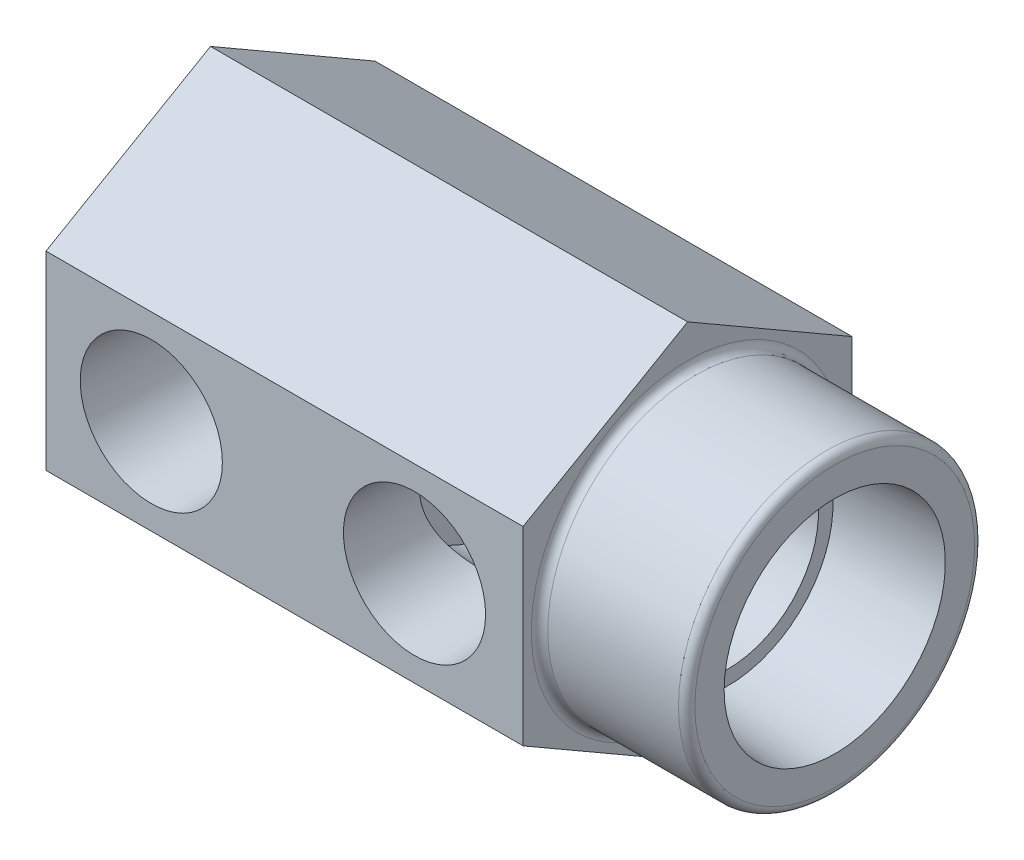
ISO-10303-21;
HEADER;
FILE_DESCRIPTION(('STEP AP214'),'2;1');
FILE_NAME('part.step','',(''),(''),'','','');
FILE_SCHEMA(('AUTOMOTIVE_DESIGN { 1 0 10303 214 1 1 1 1 }'));
ENDSEC;
DATA;
#1=APPLICATION_CONTEXT('core data for automotive mechanical design processes');
#2=APPLICATION_PROTOCOL_DEFINITION('international standard','automotive_design',2000,#1);
#3=PRODUCT_CONTEXT('',#1,'mechanical');
#4=PRODUCT('Part','Part','',(#3));
#5=PRODUCT_RELATED_PRODUCT_CATEGORY('part','',(#4));
#6=PRODUCT_DEFINITION_FORMATION('','',#4);
#7=PRODUCT_DEFINITION_CONTEXT('part definition',#1,'design');
#8=PRODUCT_DEFINITION('design','',#6,#7);
#9=PRODUCT_DEFINITION_SHAPE('','',#8);
#10=(LENGTH_UNIT() NAMED_UNIT(*) SI_UNIT(.MILLI.,.METRE.));
#11=(NAMED_UNIT(*) PLANE_ANGLE_UNIT() SI_UNIT($,.RADIAN.));
#12=(NAMED_UNIT(*) SI_UNIT($,.STERADIAN.) SOLID_ANGLE_UNIT());
#13=UNCERTAINTY_MEASURE_WITH_UNIT(LENGTH_MEASURE(1.E-05),#10,'distance_accuracy_value','');
#14=(GEOMETRIC_REPRESENTATION_CONTEXT(3) GLOBAL_UNCERTAINTY_ASSIGNED_CONTEXT((#13)) GLOBAL_UNIT_ASSIGNED_CONTEXT((#10,
#11,#12)) REPRESENTATION_CONTEXT('',''));
#15=CARTESIAN_POINT('',(0.,0.,0.));
#16=DIRECTION('',(0.,0.,1.));
#17=DIRECTION('',(1.,0.,0.));
#18=AXIS2_PLACEMENT_3D('',#15,#16,#17);
#19=CARTESIAN_POINT('',(60.2361,0.,0.));
#20=DIRECTION('',(1.,0.,0.));
#21=DIRECTION('',(0.,0.,-1.));
#22=AXIS2_PLACEMENT_3D('',#19,#20,#21);
#23=CYLINDRICAL_SURFACE('',#22,4.96100099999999);
#24=CARTESIAN_POINT('',(12.9449858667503,-4.81522299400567,1.19380000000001));
#25=CARTESIAN_POINT('',(12.9143607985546,-4.83293975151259,1.12233596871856));
#26=CARTESIAN_POINT('',(12.8854673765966,-4.84925617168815,1.0497121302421));
#27=CARTESIAN_POINT('',(12.8320641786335,-4.87888486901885,0.902055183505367));
#28=CARTESIAN_POINT('',(12.8075663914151,-4.89218895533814,0.827016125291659));
#29=CARTESIAN_POINT('',(12.7640401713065,-4.91549698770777,0.674789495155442));
#30=CARTESIAN_POINT('',(12.7450142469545,-4.92549942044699,0.597600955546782));
#31=CARTESIAN_POINT('',(12.7134617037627,-4.94192881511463,0.441621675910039));
#32=CARTESIAN_POINT('',(12.7009281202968,-4.94835960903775,0.362832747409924));
#33=CARTESIAN_POINT('',(12.6773224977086,-4.96043807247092,0.151509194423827));
#34=CARTESIAN_POINT('',(12.6727228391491,-4.96274284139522,0.0179575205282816));
#35=CARTESIAN_POINT('',(12.6847937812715,-4.95660701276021,-0.247352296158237));
#36=CARTESIAN_POINT('',(12.7013919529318,-4.9482030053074,-0.379114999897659));
#37=CARTESIAN_POINT('',(12.7604292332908,-4.91748536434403,-0.677240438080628));
#38=CARTESIAN_POINT('',(12.8091886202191,-4.89172066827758,-0.84194873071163));
#39=CARTESIAN_POINT('',(12.9272166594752,-4.82592452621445,-1.16142305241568));
#40=CARTESIAN_POINT('',(12.9966096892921,-4.78580625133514,-1.31612165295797));
#41=CARTESIAN_POINT('',(13.140582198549,-4.69735821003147,-1.60208313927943));
#42=CARTESIAN_POINT('',(13.2141439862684,-4.65008267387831,-1.73420491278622));
#43=CARTESIAN_POINT('',(13.3670624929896,-4.5459691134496,-1.99121522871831));
#44=CARTESIAN_POINT('',(13.4464238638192,-4.4891233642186,-2.11609781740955));
#45=CARTESIAN_POINT('',(13.6080845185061,-4.36618419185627,-2.3593520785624));
#46=CARTESIAN_POINT('',(13.6903859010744,-4.30008406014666,-2.4777189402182));
#47=CARTESIAN_POINT('',(13.855802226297,-4.15877402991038,-2.70820850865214));
#48=CARTESIAN_POINT('',(13.9389169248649,-4.08356679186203,-2.82033302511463));
#49=CARTESIAN_POINT('',(14.1114996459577,-3.91711020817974,-3.04783754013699));
#50=CARTESIAN_POINT('',(14.2008996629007,-3.82503760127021,-3.16266889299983));
#51=CARTESIAN_POINT('',(14.3770613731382,-3.62990401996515,-3.38484736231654));
#52=CARTESIAN_POINT('',(14.4638225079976,-3.52684074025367,-3.49219290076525));
#53=CARTESIAN_POINT('',(14.6328714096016,-3.30980456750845,-3.69852367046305));
#54=CARTESIAN_POINT('',(14.7151685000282,-3.19585590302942,-3.79752658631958));
#55=CARTESIAN_POINT('',(14.8738186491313,-2.95686319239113,-3.98644228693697));
#56=CARTESIAN_POINT('',(14.9501718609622,-2.83181943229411,-4.07635530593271));
#57=CARTESIAN_POINT('',(15.1274913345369,-2.51256042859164,-4.28357464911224));
#58=CARTESIAN_POINT('',(15.2243482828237,-2.31226966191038,-4.39533606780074));
#59=CARTESIAN_POINT('',(15.3533536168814,-1.99614817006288,-4.54318180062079));
#60=CARTESIAN_POINT('',(15.3936516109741,-1.88812564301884,-4.58917504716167));
#61=CARTESIAN_POINT('',(15.4681341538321,-1.66726856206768,-4.67393975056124));
#62=CARTESIAN_POINT('',(15.5023217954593,-1.55443647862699,-4.71271486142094));
#63=CARTESIAN_POINT('',(15.5642040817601,-1.32345475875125,-4.78275074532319));
#64=CARTESIAN_POINT('',(15.591833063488,-1.20526439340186,-4.81393559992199));
#65=CARTESIAN_POINT('',(15.6395306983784,-0.965499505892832,-4.86769173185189));
#66=CARTESIAN_POINT('',(15.6596033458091,-0.843926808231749,-4.89026755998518));
#67=CARTESIAN_POINT('',(15.6916990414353,-0.598447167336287,-4.92633475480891));
#68=CARTESIAN_POINT('',(15.7037260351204,-0.474541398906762,-4.93983057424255));
#69=CARTESIAN_POINT('',(15.7194246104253,-0.225544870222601,-4.95744192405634));
#70=CARTESIAN_POINT('',(15.7230973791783,-0.100454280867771,-4.96155878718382));
#71=CARTESIAN_POINT('',(15.722068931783,0.132633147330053,-4.96040545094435));
#72=CARTESIAN_POINT('',(15.7184374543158,0.24064379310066,-4.95633441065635));
#73=CARTESIAN_POINT('',(15.7049412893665,0.455815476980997,-4.94119397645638));
#74=CARTESIAN_POINT('',(15.6950746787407,0.562976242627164,-4.93012242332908));
#75=CARTESIAN_POINT('',(15.6693040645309,0.775595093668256,-4.90117202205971));
#76=CARTESIAN_POINT('',(15.6534023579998,0.881053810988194,-4.88329576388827));
#77=CARTESIAN_POINT('',(15.6158650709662,1.08963587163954,-4.8410297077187));
#78=CARTESIAN_POINT('',(15.5942271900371,1.19275825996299,-4.81663729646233));
#79=CARTESIAN_POINT('',(15.5218531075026,1.49517911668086,-4.73488430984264));
#80=CARTESIAN_POINT('',(15.4633069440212,1.69028754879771,-4.66855821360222));
#81=CARTESIAN_POINT('',(15.3287314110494,2.06557291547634,-4.51510314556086));
#82=CARTESIAN_POINT('',(15.252694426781,2.24574330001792,-4.42796511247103));
#83=CARTESIAN_POINT('',(15.1093040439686,2.54288888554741,-4.26214165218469));
#84=CARTESIAN_POINT('',(15.0451717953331,2.66376849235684,-4.18755335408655));
#85=CARTESIAN_POINT('',(14.9109003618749,2.89646427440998,-4.03010660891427));
#86=CARTESIAN_POINT('',(14.8407608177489,3.00827990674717,-3.94724766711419));
#87=CARTESIAN_POINT('',(14.6956058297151,3.22298489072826,-3.77398687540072));
#88=CARTESIAN_POINT('',(14.6205799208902,3.32585390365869,-3.68356871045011));
#89=CARTESIAN_POINT('',(14.4670312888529,3.52243557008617,-3.49605906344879));
#90=CARTESIAN_POINT('',(14.388508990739,3.61614933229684,-3.39896839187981));
#91=CARTESIAN_POINT('',(14.2274806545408,3.79645056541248,-3.19644628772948));
#92=CARTESIAN_POINT('',(14.1449253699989,3.88284342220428,-3.09088112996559));
#93=CARTESIAN_POINT('',(13.9788050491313,4.04633475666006,-2.87353477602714));
#94=CARTESIAN_POINT('',(13.8952399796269,4.1234329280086,-2.76175337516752));
#95=CARTESIAN_POINT('',(13.7287894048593,4.26830287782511,-2.53210097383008));
#96=CARTESIAN_POINT('',(13.645903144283,4.33608691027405,-2.41423826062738));
#97=CARTESIAN_POINT('',(13.4827267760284,4.46235804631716,-2.17199004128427));
#98=CARTESIAN_POINT('',(13.4024355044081,4.52084936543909,-2.04760752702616));
#99=CARTESIAN_POINT('',(13.2376153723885,4.6348678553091,-1.77590680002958));
#100=CARTESIAN_POINT('',(13.1537688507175,4.68915802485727,-1.62764380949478));
#101=CARTESIAN_POINT('',(12.9985400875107,4.78471380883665,-1.32055499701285));
#102=CARTESIAN_POINT('',(12.9271504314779,4.8259871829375,-1.16173553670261));
#103=CARTESIAN_POINT('',(12.817808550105,4.88689380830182,-0.864878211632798));
#104=CARTESIAN_POINT('',(12.7760488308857,4.90917923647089,-0.728840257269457));
#105=CARTESIAN_POINT('',(12.7127104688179,4.94241971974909,-0.451042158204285));
#106=CARTESIAN_POINT('',(12.6910592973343,4.95341551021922,-0.309304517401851));
#107=CARTESIAN_POINT('',(12.6721720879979,4.96303006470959,-0.0227062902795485));
#108=CARTESIAN_POINT('',(12.6751042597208,4.96156355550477,0.122169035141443));
#109=CARTESIAN_POINT('',(12.7051621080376,4.94620000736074,0.409193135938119));
#110=CARTESIAN_POINT('',(12.7323916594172,4.93224959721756,0.551327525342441));
#111=CARTESIAN_POINT('',(12.7920542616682,4.90055716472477,0.777085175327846));
#112=CARTESIAN_POINT('',(12.8187908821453,4.88615201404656,0.862819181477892));
#113=CARTESIAN_POINT('',(12.8779772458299,4.85348038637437,1.03077141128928));
#114=CARTESIAN_POINT('',(12.9103804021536,4.83524516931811,1.11301198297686));
#115=CARTESIAN_POINT('',(12.9449858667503,4.81522299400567,1.1938));
#116=B_SPLINE_CURVE_WITH_KNOTS('',3,(#24,#25,#26,#27,#28,#29,#30,#31,#32,#33,#34,#35,#36,#37,
#38,#39,#40,#41,#42,#43,#44,#45,#46,#47,#48,#49,#50,#51,#52,#53,#54,#55,#56,#57,#58,#59,#60,#61,
#62,#63,#64,#65,#66,#67,#68,#69,#70,#71,#72,#73,#74,#75,#76,#77,#78,#79,#80,#81,#82,#83,#84,#85,
#86,#87,#88,#89,#90,#91,#92,#93,#94,#95,#96,#97,#98,#99,#100,#101,#102,#103,#104,#105,#106,#107,
#108,#109,#110,#111,#112,#113,#114,#115),.UNSPECIFIED.,.F.,.F.,(4,2,2,2,2,2,2,2,2,2,2,2,2,2,2,2,
2,2,2,2,2,2,2,2,2,2,2,2,2,2,2,2,2,2,2,2,2,2,2,2,2,2,2,2,2,4),(0.,0.239282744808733,
0.479208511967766,0.719244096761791,0.959021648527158,1.3576921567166,1.75500411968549,
2.2730628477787,2.79430997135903,3.26897511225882,3.74402525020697,4.21942155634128,
4.69467931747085,5.21078979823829,5.72700874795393,6.24210434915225,6.75718667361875,
7.50079300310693,7.87281758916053,8.24465333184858,8.6200680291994,8.99528400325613,
9.37031584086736,9.74529438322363,10.0693364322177,10.3934784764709,10.7174972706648,
11.041646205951,11.6816270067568,12.3218869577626,12.7888300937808,13.2558011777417,
13.7238075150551,14.1917571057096,14.669686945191,15.1476325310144,15.6249431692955,
16.1020366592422,16.6374680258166,17.172579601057,17.6031728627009,18.0322069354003,
18.4641790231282,18.8980067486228,19.1705767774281,19.4410030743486),.UNSPECIFIED.);
#117=CARTESIAN_POINT('',(14.1584383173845,3.86717077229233,-3.10749435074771));
#118=VERTEX_POINT('',#117);
#119=CARTESIAN_POINT('',(12.9449858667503,4.81522299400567,1.19380000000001));
#120=VERTEX_POINT('',#119);
#121=EDGE_CURVE('E554',#118,#120,#116,.T.);
#122=ORIENTED_EDGE('',*,*,#121,.F.);
#123=CARTESIAN_POINT('',(14.1584383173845,0.,0.));
#124=DIRECTION('',(1.,0.,0.));
#125=DIRECTION('',(0.,0.,-1.));
#126=AXIS2_PLACEMENT_3D('',#123,#124,#125);
#127=CIRCLE('',#126,4.96100099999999);
#128=CARTESIAN_POINT('',(14.1584383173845,3.82612079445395,3.15789971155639));
#129=VERTEX_POINT('',#128);
#130=EDGE_CURVE('E56',#118,#129,#127,.T.);
#131=ORIENTED_EDGE('',*,*,#130,.T.);
#132=CARTESIAN_POINT('',(8.80725,4.27070422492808,2.52440415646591));
#133=CARTESIAN_POINT('',(8.90881370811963,4.2788414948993,2.51063156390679));
#134=CARTESIAN_POINT('',(9.01064747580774,4.28605769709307,2.49827730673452));
#135=CARTESIAN_POINT('',(9.21475445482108,4.29864583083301,2.47655827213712));
#136=CARTESIAN_POINT('',(9.31702770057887,4.30401761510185,2.46719373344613));
#137=CARTESIAN_POINT('',(9.52187973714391,4.3129127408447,2.45161048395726));
#138=CARTESIAN_POINT('',(9.62445847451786,4.3164363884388,2.44539125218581));
#139=CARTESIAN_POINT('',(9.82980019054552,4.321633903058,2.43619305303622));
#140=CARTESIAN_POINT('',(9.93256316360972,4.32330782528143,2.43321398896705));
#141=CARTESIAN_POINT('',(10.2371161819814,4.32552367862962,2.42928159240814));
#142=CARTESIAN_POINT('',(10.4390150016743,4.32342513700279,2.43303820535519));
#143=CARTESIAN_POINT('',(10.8419290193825,4.31210257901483,2.45304251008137));
#144=CARTESIAN_POINT('',(11.0429443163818,4.30287938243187,2.46928876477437));
#145=CARTESIAN_POINT('',(11.5218107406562,4.27231795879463,2.5219264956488));
#146=CARTESIAN_POINT('',(11.7988623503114,4.24764608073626,2.56372121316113));
#147=CARTESIAN_POINT('',(12.348214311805,4.18448762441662,2.66554687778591));
#148=CARTESIAN_POINT('',(12.6205091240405,4.14598593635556,2.72559775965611));
#149=CARTESIAN_POINT('',(13.0282236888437,4.07701847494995,2.82686758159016));
#150=CARTESIAN_POINT('',(13.1658279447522,4.05174621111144,2.86304831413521));
#151=CARTESIAN_POINT('',(13.4394404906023,3.99737616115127,2.9384818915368));
#152=CARTESIAN_POINT('',(13.5754487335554,3.96827826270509,2.97773482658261));
#153=CARTESIAN_POINT('',(13.8454681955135,3.90621434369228,3.05869540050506));
#154=CARTESIAN_POINT('',(13.979483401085,3.87325770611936,3.10039696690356));
#155=CARTESIAN_POINT('',(14.2457549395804,3.80325427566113,3.18588074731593));
#156=CARTESIAN_POINT('',(14.3780114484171,3.76620789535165,3.22966275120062));
#157=CARTESIAN_POINT('',(14.5093561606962,3.72702996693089,3.27426));
#158=B_SPLINE_CURVE_WITH_KNOTS('',3,(#132,#133,#134,#135,#136,#137,#138,#139,#140,#141,#142,
#143,#144,#145,#146,#147,#148,#149,#150,#151,#152,#153,#154,#155,#156,#157),.UNSPECIFIED.,.F.,
.F.,(4,2,2,2,2,2,2,2,2,2,2,2,4),(0.,0.308438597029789,0.616901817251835,0.925313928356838,
1.23371683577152,1.8389716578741,2.44415684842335,3.28680184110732,4.13037028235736,
4.56382041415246,4.99728327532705,5.42971319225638,5.86209952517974),.UNSPECIFIED.);
#159=CARTESIAN_POINT('',(9.4361,4.30917981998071,2.4581497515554));
#160=VERTEX_POINT('',#159);
#161=EDGE_CURVE('E169',#160,#129,#158,.T.);
#162=ORIENTED_EDGE('',*,*,#161,.F.);
#163=CARTESIAN_POINT('',(9.4361,0.,0.));
#164=DIRECTION('',(1.,0.,0.));
#165=DIRECTION('',(0.,0.,-1.));
#166=AXIS2_PLACEMENT_3D('',#163,#164,#165);
#167=CIRCLE('',#166,4.96100099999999);
#168=CARTESIAN_POINT('',(9.4361,4.65962196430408,1.70277833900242));
#169=VERTEX_POINT('',#168);
#170=EDGE_CURVE('E497',#169,#160,#167,.T.);
#171=ORIENTED_EDGE('',*,*,#170,.F.);
#172=CARTESIAN_POINT('',(13.2249858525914,4.838751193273,1.09454000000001));
#173=CARTESIAN_POINT('',(13.1011105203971,4.82859042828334,1.13950879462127));
#174=CARTESIAN_POINT('',(12.9768307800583,4.81801345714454,1.18330473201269));
#175=CARTESIAN_POINT('',(12.7272224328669,4.79643864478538,1.26790607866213));
#176=CARTESIAN_POINT('',(12.6018933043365,4.78544058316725,1.30870988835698));
#177=CARTESIAN_POINT('',(12.348917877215,4.7633455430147,1.38699177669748));
#178=CARTESIAN_POINT('',(12.2212608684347,4.75224858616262,1.42443577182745));
#179=CARTESIAN_POINT('',(11.9646602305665,4.73062645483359,1.49467448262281));
#180=CARTESIAN_POINT('',(11.8357167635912,4.72010120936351,1.52746977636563));
#181=CARTESIAN_POINT('',(11.4567649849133,4.69116790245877,1.61498075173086));
#182=CARTESIAN_POINT('',(11.2046887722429,4.67443341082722,1.66204773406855));
#183=CARTESIAN_POINT('',(10.8239592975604,4.65671683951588,1.71079401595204));
#184=CARTESIAN_POINT('',(10.6968536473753,4.65204406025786,1.72339712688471));
#185=CARTESIAN_POINT('',(10.4420172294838,4.64560558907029,1.74068063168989));
#186=CARTESIAN_POINT('',(10.3142865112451,4.64383967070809,1.74536164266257));
#187=CARTESIAN_POINT('',(10.0715894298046,4.6434331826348,1.74644121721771));
#188=CARTESIAN_POINT('',(9.9566260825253,4.64449727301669,1.74362244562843));
#189=CARTESIAN_POINT('',(9.72710561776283,4.64903676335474,1.73148169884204));
#190=CARTESIAN_POINT('',(9.61254846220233,4.65251193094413,1.72216035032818));
#191=CARTESIAN_POINT('',(9.38218171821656,4.66165804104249,1.69724917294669));
#192=CARTESIAN_POINT('',(9.26638554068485,4.66736652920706,1.68155197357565));
#193=CARTESIAN_POINT('',(9.03594755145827,4.68050184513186,1.64462910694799));
#194=CARTESIAN_POINT('',(8.92130427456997,4.68792609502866,1.6234117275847));
#195=CARTESIAN_POINT('',(8.80724999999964,4.69598138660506,1.59977802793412));
#196=B_SPLINE_CURVE_WITH_KNOTS('',3,(#172,#173,#174,#175,#176,#177,#178,#179,#180,#181,#182,
#183,#184,#185,#186,#187,#188,#189,#190,#191,#192,#193,#194,#195),.UNSPECIFIED.,.F.,.F.,(4,2,2,
2,2,2,2,2,2,2,2,4),(0.,0.396538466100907,0.793287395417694,1.19368964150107,1.59404205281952,
2.3633172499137,2.74652478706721,3.12970247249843,3.47449821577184,3.81926073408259,
4.17008716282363,4.5203898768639),.UNSPECIFIED.);
#197=EDGE_CURVE('E535',#120,#169,#196,.T.);
#198=ORIENTED_EDGE('',*,*,#197,.F.);
#199=EDGE_LOOP('',(#122,#131,#162,#171,#198));
#200=FACE_BOUND('',#199,.T.);
#201=ADVANCED_FACE('F35',(#200),#23,.F.);
#202=CARTESIAN_POINT('',(60.2361,0.,0.));
#203=DIRECTION('',(1.,0.,0.));
#204=DIRECTION('',(0.,0.,-1.));
#205=AXIS2_PLACEMENT_3D('',#202,#203,#204);
#206=PLANE('',#205);
#207=CARTESIAN_POINT('',(60.2361,0.,0.));
#208=DIRECTION('',(1.,0.,0.));
#209=DIRECTION('',(0.,0.,-1.));
#210=AXIS2_PLACEMENT_3D('',#207,#208,#209);
#211=CIRCLE('',#210,13.49375);
#212=CARTESIAN_POINT('',(60.2361,0.,-13.49375));
#213=VERTEX_POINT('',#212);
#214=EDGE_CURVE('E309',#213,#213,#211,.T.);
#215=ORIENTED_EDGE('',*,*,#214,.T.);
#216=EDGE_LOOP('',(#215));
#217=FACE_BOUND('',#216,.T.);
#218=CARTESIAN_POINT('',(60.2361,0.,0.));
#219=DIRECTION('',(-1.,0.,0.));
#220=DIRECTION('',(0.,0.,1.));
#221=AXIS2_PLACEMENT_3D('',#218,#219,#220);
#222=CIRCLE('',#221,10.6743844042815);
#223=CARTESIAN_POINT('',(60.2361,0.,10.6743844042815));
#224=VERTEX_POINT('',#223);
#225=EDGE_CURVE('E387',#224,#224,#222,.T.);
#226=ORIENTED_EDGE('',*,*,#225,.T.);
#227=EDGE_LOOP('',(#226));
#228=FACE_BOUND('',#227,.T.);
#229=ADVANCED_FACE('F474',(#217,#228),#206,.T.);
#230=CARTESIAN_POINT('',(46.0375,-9.16543552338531,-15.875));
#231=DIRECTION('',(1.,0.,0.));
#232=DIRECTION('',(0.,0.,-1.));
#233=AXIS2_PLACEMENT_3D('',#230,#231,#232);
#234=PLANE('',#233);
#235=CARTESIAN_POINT('',(46.0375,0.,0.));
#236=DIRECTION('',(1.,0.,0.));
#237=DIRECTION('',(0.,0.,-1.));
#238=AXIS2_PLACEMENT_3D('',#235,#236,#237);
#239=CIRCLE('',#238,15.08125);
#240=CARTESIAN_POINT('',(46.0375,0.,-15.08125));
#241=VERTEX_POINT('',#240);
#242=EDGE_CURVE('E297',#241,#241,#239,.F.);
#243=ORIENTED_EDGE('',*,*,#242,.T.);
#244=EDGE_LOOP('',(#243));
#245=FACE_BOUND('',#244,.T.);
#246=DIRECTION('',(0.,0.5,-0.866025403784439));
#247=VECTOR('',#246,1.);
#248=CARTESIAN_POINT('',(46.0375,-18.3308710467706,0.));
#249=LINE('',#248,#247);
#250=CARTESIAN_POINT('',(46.0375,-18.3308710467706,0.));
#251=VERTEX_POINT('',#250);
#252=CARTESIAN_POINT('',(46.0375,-9.16543552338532,-15.875));
#253=VERTEX_POINT('',#252);
#254=EDGE_CURVE('E391',#251,#253,#249,.T.);
#255=ORIENTED_EDGE('',*,*,#254,.T.);
#256=DIRECTION('',(0.,1.,0.));
#257=VECTOR('',#256,1.);
#258=CARTESIAN_POINT('',(46.0375,-9.16543552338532,-15.875));
#259=LINE('',#258,#257);
#260=CARTESIAN_POINT('',(46.0375,9.16543552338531,-15.875));
#261=VERTEX_POINT('',#260);
#262=EDGE_CURVE('E394',#253,#261,#259,.T.);
#263=ORIENTED_EDGE('',*,*,#262,.T.);
#264=DIRECTION('',(0.,0.5,0.866025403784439));
#265=VECTOR('',#264,1.);
#266=CARTESIAN_POINT('',(46.0375,9.16543552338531,-15.875));
#267=LINE('',#266,#265);
#268=CARTESIAN_POINT('',(46.0375,18.3308710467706,0.));
#269=VERTEX_POINT('',#268);
#270=EDGE_CURVE('E397',#261,#269,#267,.T.);
#271=ORIENTED_EDGE('',*,*,#270,.T.);
#272=DIRECTION('',(0.,-0.5,0.866025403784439));
#273=VECTOR('',#272,1.);
#274=CARTESIAN_POINT('',(46.0375,18.3308710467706,0.));
#275=LINE('',#274,#273);
#276=CARTESIAN_POINT('',(46.0375,9.16543552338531,15.875));
#277=VERTEX_POINT('',#276);
#278=EDGE_CURVE('E399',#269,#277,#275,.T.);
#279=ORIENTED_EDGE('',*,*,#278,.T.);
#280=DIRECTION('',(0.,-1.,0.));
#281=VECTOR('',#280,1.);
#282=CARTESIAN_POINT('',(46.0375,9.16543552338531,15.875));
#283=LINE('',#282,#281);
#284=CARTESIAN_POINT('',(46.0375,-9.16543552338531,15.875));
#285=VERTEX_POINT('',#284);
#286=EDGE_CURVE('E401',#277,#285,#283,.T.);
#287=ORIENTED_EDGE('',*,*,#286,.T.);
#288=DIRECTION('',(0.,-0.5,-0.866025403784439));
#289=VECTOR('',#288,1.);
#290=CARTESIAN_POINT('',(46.0375,-9.16543552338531,15.875));
#291=LINE('',#290,#289);
#292=EDGE_CURVE('E403',#285,#251,#291,.T.);
#293=ORIENTED_EDGE('',*,*,#292,.T.);
#294=EDGE_LOOP('',(#255,#263,#271,#279,#287,#293));
#295=FACE_BOUND('',#294,.T.);
#296=ADVANCED_FACE('F455',(#245,#295),#234,.T.);
#297=CARTESIAN_POINT('',(46.0375,-18.3308710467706,0.));
#298=DIRECTION('',(0.,0.866025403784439,0.5));
#299=DIRECTION('',(0.,-0.5,0.866025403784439));
#300=AXIS2_PLACEMENT_3D('',#297,#298,#299);
#301=PLANE('',#300);
#302=DIRECTION('',(0.,0.5,-0.866025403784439));
#303=VECTOR('',#302,1.);
#304=CARTESIAN_POINT('',(0.,-18.3308710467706,0.));
#305=LINE('',#304,#303);
#306=CARTESIAN_POINT('',(0.,-18.3308710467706,0.));
#307=VERTEX_POINT('',#306);
#308=CARTESIAN_POINT('',(0.,-9.16543552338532,-15.875));
#309=VERTEX_POINT('',#308);
#310=EDGE_CURVE('E390',#307,#309,#305,.T.);
#311=ORIENTED_EDGE('',*,*,#310,.T.);
#312=DIRECTION('',(-1.,0.,0.));
#313=VECTOR('',#312,1.);
#314=CARTESIAN_POINT('',(46.0375,-9.16543552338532,-15.875));
#315=LINE('',#314,#313);
#316=EDGE_CURVE('E343',#253,#309,#315,.T.);
#317=ORIENTED_EDGE('',*,*,#316,.F.);
#318=ORIENTED_EDGE('',*,*,#254,.F.);
#319=DIRECTION('',(-1.,0.,0.));
#320=VECTOR('',#319,1.);
#321=CARTESIAN_POINT('',(46.0375,-18.3308710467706,0.));
#322=LINE('',#321,#320);
#323=EDGE_CURVE('E405',#251,#307,#322,.T.);
#324=ORIENTED_EDGE('',*,*,#323,.T.);
#325=EDGE_LOOP('',(#311,#317,#318,#324));
#326=FACE_BOUND('',#325,.T.);
#327=ADVANCED_FACE('F440',(#326),#301,.F.);
#328=CARTESIAN_POINT('',(46.0375,-9.16543552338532,-15.875));
#329=DIRECTION('',(0.,0.,1.));
#330=DIRECTION('',(1.,0.,0.));
#331=AXIS2_PLACEMENT_3D('',#328,#329,#330);
#332=PLANE('',#331);
#333=CARTESIAN_POINT('',(10.16,0.,-15.875));
#334=DIRECTION('',(0.,0.,-1.));
#335=DIRECTION('',(-1.,0.,0.));
#336=AXIS2_PLACEMENT_3D('',#333,#334,#335);
#337=CIRCLE('',#336,6.858);
#338=CARTESIAN_POINT('',(3.302,0.,-15.875));
#339=VERTEX_POINT('',#338);
#340=EDGE_CURVE('E362',#339,#339,#337,.T.);
#341=ORIENTED_EDGE('',*,*,#340,.F.);
#342=EDGE_LOOP('',(#341));
#343=FACE_BOUND('',#342,.T.);
#344=DIRECTION('',(0.,1.,0.));
#345=VECTOR('',#344,1.);
#346=CARTESIAN_POINT('',(0.,-9.16543552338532,-15.875));
#347=LINE('',#346,#345);
#348=CARTESIAN_POINT('',(0.,9.16543552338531,-15.875));
#349=VERTEX_POINT('',#348);
#350=EDGE_CURVE('E408',#309,#349,#347,.T.);
#351=ORIENTED_EDGE('',*,*,#350,.T.);
#352=DIRECTION('',(-1.,0.,0.));
#353=VECTOR('',#352,1.);
#354=CARTESIAN_POINT('',(46.0375,9.16543552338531,-15.875));
#355=LINE('',#354,#353);
#356=EDGE_CURVE('E427',#261,#349,#355,.T.);
#357=ORIENTED_EDGE('',*,*,#356,.F.);
#358=ORIENTED_EDGE('',*,*,#262,.F.);
#359=ORIENTED_EDGE('',*,*,#316,.T.);
#360=EDGE_LOOP('',(#351,#357,#358,#359));
#361=FACE_BOUND('',#360,.T.);
#362=ADVANCED_FACE('F436',(#343,#361),#332,.F.);
#363=CARTESIAN_POINT('',(46.0375,9.16543552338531,-15.875));
#364=DIRECTION('',(0.,-0.866025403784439,0.5));
#365=DIRECTION('',(0.,-0.5,-0.866025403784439));
#366=AXIS2_PLACEMENT_3D('',#363,#364,#365);
#367=PLANE('',#366);
#368=DIRECTION('',(0.,0.5,0.866025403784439));
#369=VECTOR('',#368,1.);
#370=CARTESIAN_POINT('',(0.,9.16543552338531,-15.875));
#371=LINE('',#370,#369);
#372=CARTESIAN_POINT('',(0.,18.3308710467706,0.));
#373=VERTEX_POINT('',#372);
#374=EDGE_CURVE('E410',#349,#373,#371,.T.);
#375=ORIENTED_EDGE('',*,*,#374,.T.);
#376=DIRECTION('',(-1.,0.,0.));
#377=VECTOR('',#376,1.);
#378=CARTESIAN_POINT('',(46.0375,18.3308710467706,0.));
#379=LINE('',#378,#377);
#380=EDGE_CURVE('E425',#269,#373,#379,.T.);
#381=ORIENTED_EDGE('',*,*,#380,.F.);
#382=ORIENTED_EDGE('',*,*,#270,.F.);
#383=ORIENTED_EDGE('',*,*,#356,.T.);
#384=EDGE_LOOP('',(#375,#381,#382,#383));
#385=FACE_BOUND('',#384,.T.);
#386=ADVANCED_FACE('F448',(#385),#367,.F.);
#387=CARTESIAN_POINT('',(46.0375,18.3308710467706,0.));
#388=DIRECTION('',(0.,-0.866025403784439,-0.5));
#389=DIRECTION('',(0.,0.5,-0.866025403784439));
#390=AXIS2_PLACEMENT_3D('',#387,#388,#389);
#391=PLANE('',#390);
#392=DIRECTION('',(0.,-0.5,0.866025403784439));
#393=VECTOR('',#392,1.);
#394=CARTESIAN_POINT('',(0.,18.3308710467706,0.));
#395=LINE('',#394,#393);
#396=CARTESIAN_POINT('',(0.,9.16543552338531,15.875));
#397=VERTEX_POINT('',#396);
#398=EDGE_CURVE('E412',#373,#397,#395,.T.);
#399=ORIENTED_EDGE('',*,*,#398,.T.);
#400=DIRECTION('',(-1.,0.,0.));
#401=VECTOR('',#400,1.);
#402=CARTESIAN_POINT('',(46.0375,9.16543552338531,15.875));
#403=LINE('',#402,#401);
#404=EDGE_CURVE('E422',#277,#397,#403,.T.);
#405=ORIENTED_EDGE('',*,*,#404,.F.);
#406=ORIENTED_EDGE('',*,*,#278,.F.);
#407=ORIENTED_EDGE('',*,*,#380,.T.);
#408=EDGE_LOOP('',(#399,#405,#406,#407));
#409=FACE_BOUND('',#408,.T.);
#410=ADVANCED_FACE('F451',(#409),#391,.F.);
#411=CARTESIAN_POINT('',(46.0375,9.16543552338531,15.875));
#412=DIRECTION('',(0.,0.,-1.));
#413=DIRECTION('',(-1.,0.,0.));
#414=AXIS2_PLACEMENT_3D('',#411,#412,#413);
#415=PLANE('',#414);
#416=CARTESIAN_POINT('',(10.16,0.,15.875));
#417=DIRECTION('',(0.,0.,1.));
#418=DIRECTION('',(1.,0.,0.));
#419=AXIS2_PLACEMENT_3D('',#416,#417,#418);
#420=CIRCLE('',#419,6.858);
#421=CARTESIAN_POINT('',(17.018,0.,15.875));
#422=VERTEX_POINT('',#421);
#423=EDGE_CURVE('E534',#422,#422,#420,.T.);
#424=ORIENTED_EDGE('',*,*,#423,.F.);
#425=EDGE_LOOP('',(#424));
#426=FACE_BOUND('',#425,.T.);
#427=CARTESIAN_POINT('',(35.56,0.,15.875));
#428=DIRECTION('',(0.,0.,1.));
#429=DIRECTION('',(1.,0.,0.));
#430=AXIS2_PLACEMENT_3D('',#427,#428,#429);
#431=CIRCLE('',#430,6.858);
#432=CARTESIAN_POINT('',(42.418,0.,15.875));
#433=VERTEX_POINT('',#432);
#434=EDGE_CURVE('E315',#433,#433,#431,.T.);
#435=ORIENTED_EDGE('',*,*,#434,.F.);
#436=EDGE_LOOP('',(#435));
#437=FACE_BOUND('',#436,.T.);
#438=DIRECTION('',(0.,-1.,0.));
#439=VECTOR('',#438,1.);
#440=CARTESIAN_POINT('',(0.,9.16543552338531,15.875));
#441=LINE('',#440,#439);
#442=CARTESIAN_POINT('',(0.,-9.16543552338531,15.875));
#443=VERTEX_POINT('',#442);
#444=EDGE_CURVE('E414',#397,#443,#441,.T.);
#445=ORIENTED_EDGE('',*,*,#444,.T.);
#446=DIRECTION('',(-1.,0.,0.));
#447=VECTOR('',#446,1.);
#448=CARTESIAN_POINT('',(46.0375,-9.16543552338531,15.875));
#449=LINE('',#448,#447);
#450=EDGE_CURVE('E419',#285,#443,#449,.T.);
#451=ORIENTED_EDGE('',*,*,#450,.F.);
#452=ORIENTED_EDGE('',*,*,#286,.F.);
#453=ORIENTED_EDGE('',*,*,#404,.T.);
#454=EDGE_LOOP('',(#445,#451,#452,#453));
#455=FACE_BOUND('',#454,.T.);
#456=ADVANCED_FACE('F461',(#426,#437,#455),#415,.F.);
#457=CARTESIAN_POINT('',(46.0375,-9.16543552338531,15.875));
#458=DIRECTION('',(0.,0.866025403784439,-0.5));
#459=DIRECTION('',(0.,0.5,0.866025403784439));
#460=AXIS2_PLACEMENT_3D('',#457,#458,#459);
#461=PLANE('',#460);
#462=DIRECTION('',(0.,-0.5,-0.866025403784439));
#463=VECTOR('',#462,1.);
#464=CARTESIAN_POINT('',(0.,-9.16543552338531,15.875));
#465=LINE('',#464,#463);
#466=EDGE_CURVE('E395',#443,#307,#465,.T.);
#467=ORIENTED_EDGE('',*,*,#466,.T.);
#468=ORIENTED_EDGE('',*,*,#323,.F.);
#469=ORIENTED_EDGE('',*,*,#292,.F.);
#470=ORIENTED_EDGE('',*,*,#450,.T.);
#471=EDGE_LOOP('',(#467,#468,#469,#470));
#472=FACE_BOUND('',#471,.T.);
#473=ADVANCED_FACE('F459',(#472),#461,.F.);
#474=CARTESIAN_POINT('',(0.,-9.16543552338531,-15.875));
#475=DIRECTION('',(1.,0.,0.));
#476=DIRECTION('',(0.,0.,-1.));
#477=AXIS2_PLACEMENT_3D('',#474,#475,#476);
#478=PLANE('',#477);
#479=ORIENTED_EDGE('',*,*,#310,.F.);
#480=ORIENTED_EDGE('',*,*,#466,.F.);
#481=ORIENTED_EDGE('',*,*,#444,.F.);
#482=ORIENTED_EDGE('',*,*,#398,.F.);
#483=ORIENTED_EDGE('',*,*,#374,.F.);
#484=ORIENTED_EDGE('',*,*,#350,.F.);
#485=EDGE_LOOP('',(#479,#480,#481,#482,#483,#484));
#486=FACE_BOUND('',#485,.T.);
#487=ADVANCED_FACE('F444',(#486),#478,.F.);
#488=CARTESIAN_POINT('',(60.2361,0.,0.));
#489=DIRECTION('',(-1.,0.,0.));
#490=DIRECTION('',(0.,0.,1.));
#491=AXIS2_PLACEMENT_3D('',#488,#489,#490);
#492=CYLINDRICAL_SURFACE('',#491,14.2875);
#493=CARTESIAN_POINT('',(59.44235,0.,0.));
#494=DIRECTION('',(1.,0.,0.));
#495=DIRECTION('',(0.,0.,-1.));
#496=AXIS2_PLACEMENT_3D('',#493,#494,#495);
#497=CIRCLE('',#496,14.2875);
#498=CARTESIAN_POINT('',(59.44235,0.,14.2875));
#499=VERTEX_POINT('',#498);
#500=EDGE_CURVE('E300',#499,#499,#497,.F.);
#501=CARTESIAN_POINT('',(46.83125,0.,0.));
#502=DIRECTION('',(1.,0.,0.));
#503=DIRECTION('',(0.,0.,-1.));
#504=AXIS2_PLACEMENT_3D('',#501,#502,#503);
#505=CIRCLE('',#504,14.2875);
#506=CARTESIAN_POINT('',(46.83125,0.,14.2875));
#507=VERTEX_POINT('',#506);
#508=EDGE_CURVE('E304',#507,#507,#505,.T.);
#509=CARTESIAN_POINT('',(59.44235,0.,14.2875));
#510=CARTESIAN_POINT('',(59.310984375,0.,14.2875));
#511=CARTESIAN_POINT('',(59.17961875,0.,14.2875));
#512=CARTESIAN_POINT('',(58.9168875,0.,14.2875));
#513=CARTESIAN_POINT('',(58.785521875,0.,14.2875));
#514=CARTESIAN_POINT('',(58.522790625,0.,14.2875));
#515=CARTESIAN_POINT('',(58.391425,0.,14.2875));
#516=CARTESIAN_POINT('',(58.12869375,0.,14.2875));
#517=CARTESIAN_POINT('',(57.997328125,0.,14.2875));
#518=CARTESIAN_POINT('',(57.734596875,0.,14.2875));
#519=CARTESIAN_POINT('',(57.60323125,0.,14.2875));
#520=CARTESIAN_POINT('',(57.3405,0.,14.2875));
#521=CARTESIAN_POINT('',(57.209134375,0.,14.2875));
#522=CARTESIAN_POINT('',(56.946403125,0.,14.2875));
#523=CARTESIAN_POINT('',(56.8150375,0.,14.2875));
#524=CARTESIAN_POINT('',(56.55230625,0.,14.2875));
#525=CARTESIAN_POINT('',(56.420940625,0.,14.2875));
#526=CARTESIAN_POINT('',(56.158209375,0.,14.2875));
#527=CARTESIAN_POINT('',(56.02684375,0.,14.2875));
#528=CARTESIAN_POINT('',(55.7641125,0.,14.2875));
#529=CARTESIAN_POINT('',(55.632746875,0.,14.2875));
#530=CARTESIAN_POINT('',(55.370015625,0.,14.2875));
#531=CARTESIAN_POINT('',(55.23865,0.,14.2875));
#532=CARTESIAN_POINT('',(54.97591875,0.,14.2875));
#533=CARTESIAN_POINT('',(54.844553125,0.,14.2875));
#534=CARTESIAN_POINT('',(54.581821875,0.,14.2875));
#535=CARTESIAN_POINT('',(54.45045625,0.,14.2875));
#536=CARTESIAN_POINT('',(54.187725,0.,14.2875));
#537=CARTESIAN_POINT('',(54.056359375,0.,14.2875));
#538=CARTESIAN_POINT('',(53.793628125,0.,14.2875));
#539=CARTESIAN_POINT('',(53.6622625,0.,14.2875));
#540=CARTESIAN_POINT('',(53.39953125,0.,14.2875));
#541=CARTESIAN_POINT('',(53.268165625,0.,14.2875));
#542=CARTESIAN_POINT('',(53.005434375,0.,14.2875));
#543=CARTESIAN_POINT('',(52.87406875,0.,14.2875));
#544=CARTESIAN_POINT('',(52.6113375,0.,14.2875));
#545=CARTESIAN_POINT('',(52.479971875,0.,14.2875));
#546=CARTESIAN_POINT('',(52.217240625,0.,14.2875));
#547=CARTESIAN_POINT('',(52.085875,0.,14.2875));
#548=CARTESIAN_POINT('',(51.82314375,0.,14.2875));
#549=CARTESIAN_POINT('',(51.691778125,0.,14.2875));
#550=CARTESIAN_POINT('',(51.429046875,0.,14.2875));
#551=CARTESIAN_POINT('',(51.29768125,0.,14.2875));
#552=CARTESIAN_POINT('',(51.03495,0.,14.2875));
#553=CARTESIAN_POINT('',(50.903584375,0.,14.2875));
#554=CARTESIAN_POINT('',(50.640853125,0.,14.2875));
#555=CARTESIAN_POINT('',(50.5094875,0.,14.2875));
#556=CARTESIAN_POINT('',(50.24675625,0.,14.2875));
#557=CARTESIAN_POINT('',(50.115390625,0.,14.2875));
#558=CARTESIAN_POINT('',(49.852659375,0.,14.2875));
#559=CARTESIAN_POINT('',(49.72129375,0.,14.2875));
#560=CARTESIAN_POINT('',(49.4585625,0.,14.2875));
#561=CARTESIAN_POINT('',(49.327196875,0.,14.2875));
#562=CARTESIAN_POINT('',(49.064465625,0.,14.2875));
#563=CARTESIAN_POINT('',(48.9331,0.,14.2875));
#564=CARTESIAN_POINT('',(48.67036875,0.,14.2875));
#565=CARTESIAN_POINT('',(48.539003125,0.,14.2875));
#566=CARTESIAN_POINT('',(48.276271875,0.,14.2875));
#567=CARTESIAN_POINT('',(48.14490625,0.,14.2875));
#568=CARTESIAN_POINT('',(47.882175,0.,14.2875));
#569=CARTESIAN_POINT('',(47.750809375,0.,14.2875));
#570=CARTESIAN_POINT('',(47.488078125,0.,14.2875));
#571=CARTESIAN_POINT('',(47.3567125,0.,14.2875));
#572=CARTESIAN_POINT('',(47.09398125,0.,14.2875));
#573=CARTESIAN_POINT('',(46.962615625,0.,14.2875));
#574=CARTESIAN_POINT('',(46.83125,0.,14.2875));
#575=B_SPLINE_CURVE_WITH_KNOTS('',3,(#509,#510,#511,#512,#513,#514,#515,#516,#517,#518,#519,
#520,#521,#522,#523,#524,#525,#526,#527,#528,#529,#530,#531,#532,#533,#534,#535,#536,#537,#538,
#539,#540,#541,#542,#543,#544,#545,#546,#547,#548,#549,#550,#551,#552,#553,#554,#555,#556,#557,
#558,#559,#560,#561,#562,#563,#564,#565,#566,#567,#568,#569,#570,#571,#572,#573,#574),
.UNSPECIFIED.,.F.,.F.,(4,2,2,2,2,2,2,2,2,2,2,2,2,2,2,2,2,2,2,2,2,2,2,2,2,2,2,2,2,2,2,2,4),(0.,
0.394096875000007,0.788193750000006,1.18229062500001,1.57638750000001,1.970484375,2.36458125,
2.758678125,3.152775,3.546871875,3.94096875,4.335065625,4.7291625,5.123259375,5.51735625,
5.911453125,6.30555,6.699646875,7.09374375,7.487840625,7.8819375,8.276034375,8.67013125,
9.064228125,9.458325,9.852421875,10.24651875,10.640615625,11.0347125,11.428809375,11.82290625,
12.217003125,12.6111),.UNSPECIFIED.);
#576=EDGE_CURVE('BSEAM588',#499,#507,#575,.T.);
#577=ORIENTED_EDGE('',*,*,#500,.T.);
#578=ORIENTED_EDGE('',*,*,#508,.T.);
#579=ORIENTED_EDGE('',*,*,#576,.T.);
#580=ORIENTED_EDGE('',*,*,#576,.F.);
#581=EDGE_LOOP('',(#577,#579,#578,#580));
#582=FACE_BOUND('',#581,.T.);
#583=ADVANCED_FACE('F588',(#582),#492,.T.);
#584=CARTESIAN_POINT('',(60.2361,0.,0.));
#585=DIRECTION('',(1.,0.,0.));
#586=DIRECTION('',(0.,0.,-1.));
#587=AXIS2_PLACEMENT_3D('',#584,#585,#586);
#588=CONICAL_SURFACE('',#587,10.6743844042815,0.0523598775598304);
#589=CARTESIAN_POINT('',(49.9364,0.,0.));
#590=DIRECTION('',(-1.,0.,0.));
#591=DIRECTION('',(0.,0.,1.));
#592=AXIS2_PLACEMENT_3D('',#589,#590,#591);
#593=CIRCLE('',#592,10.1346);
#594=CARTESIAN_POINT('',(49.9364,0.,10.1346));
#595=VERTEX_POINT('',#594);
#596=EDGE_CURVE('E384',#595,#595,#593,.T.);
#597=ORIENTED_EDGE('',*,*,#596,.T.);
#598=EDGE_LOOP('',(#597));
#599=FACE_BOUND('',#598,.T.);
#600=ORIENTED_EDGE('',*,*,#225,.F.);
#601=EDGE_LOOP('',(#600));
#602=FACE_BOUND('',#601,.T.);
#603=ADVANCED_FACE('F583',(#599,#602),#588,.F.);
#604=CARTESIAN_POINT('',(49.9364,0.,-8.73125));
#605=DIRECTION('',(1.,0.,0.));
#606=DIRECTION('',(0.,0.,-1.));
#607=AXIS2_PLACEMENT_3D('',#604,#605,#606);
#608=PLANE('',#607);
#609=CARTESIAN_POINT('',(49.9364,0.,0.));
#610=DIRECTION('',(-1.,0.,0.));
#611=DIRECTION('',(0.,0.,1.));
#612=AXIS2_PLACEMENT_3D('',#609,#610,#611);
#613=CIRCLE('',#612,8.73125);
#614=CARTESIAN_POINT('',(49.9364,0.,8.73125));
#615=VERTEX_POINT('',#614);
#616=EDGE_CURVE('E381',#615,#615,#613,.T.);
#617=ORIENTED_EDGE('',*,*,#616,.T.);
#618=EDGE_LOOP('',(#617));
#619=FACE_BOUND('',#618,.T.);
#620=ORIENTED_EDGE('',*,*,#596,.F.);
#621=EDGE_LOOP('',(#620));
#622=FACE_BOUND('',#621,.T.);
#623=ADVANCED_FACE('F331',(#619,#622),#608,.T.);
#624=CARTESIAN_POINT('',(-14.0019251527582,0.,0.));
#625=DIRECTION('',(-1.,0.,0.));
#626=DIRECTION('',(0.,0.,1.));
#627=AXIS2_PLACEMENT_3D('',#624,#625,#626);
#628=CYLINDRICAL_SURFACE('',#627,8.73124999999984);
#629=CARTESIAN_POINT('',(36.5834505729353,6.47761964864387,5.85450000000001));
#630=CARTESIAN_POINT('',(36.76144880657,6.45042693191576,5.88455494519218));
#631=CARTESIAN_POINT('',(36.9369183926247,6.41631096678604,5.92191923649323));
#632=CARTESIAN_POINT('',(37.2814132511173,6.33525267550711,6.00856820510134));
#633=CARTESIAN_POINT('',(37.4504530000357,6.28834137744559,6.05782401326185));
#634=CARTESIAN_POINT('',(37.7801389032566,6.18302881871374,6.16526204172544));
#635=CARTESIAN_POINT('',(37.9408448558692,6.12473010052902,6.22336364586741));
#636=CARTESIAN_POINT('',(38.25517903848,5.99710025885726,6.34644681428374));
#637=CARTESIAN_POINT('',(38.4088025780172,5.92776195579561,6.41143284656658));
#638=CARTESIAN_POINT('',(38.707328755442,5.77933033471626,6.54553043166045));
#639=CARTESIAN_POINT('',(38.8522985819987,5.70033255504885,6.61459856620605));
#640=CARTESIAN_POINT('',(39.1348731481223,5.53252891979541,6.75558203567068));
#641=CARTESIAN_POINT('',(39.2724795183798,5.443725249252,6.82749673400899));
#642=CARTESIAN_POINT('',(39.6752408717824,5.16221457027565,7.04575021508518));
#643=CARTESIAN_POINT('',(39.9293731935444,4.95489035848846,7.1941445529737));
#644=CARTESIAN_POINT('',(40.3126943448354,4.59122379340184,7.42848774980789));
#645=CARTESIAN_POINT('',(40.452002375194,4.44646481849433,7.51625214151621));
#646=CARTESIAN_POINT('',(40.7179162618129,4.14323846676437,7.68756000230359));
#647=CARTESIAN_POINT('',(40.8445195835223,3.9847683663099,7.77110262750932));
#648=CARTESIAN_POINT('',(41.0835324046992,3.65493326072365,7.93156801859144));
#649=CARTESIAN_POINT('',(41.1959721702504,3.48359704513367,8.00850478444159));
#650=CARTESIAN_POINT('',(41.4055339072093,3.1284025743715,8.15380839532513));
#651=CARTESIAN_POINT('',(41.5026626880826,2.94454993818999,8.22217904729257));
#652=CARTESIAN_POINT('',(41.6554142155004,2.61797215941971,8.33077547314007));
#653=CARTESIAN_POINT('',(41.7150797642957,2.47797028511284,8.37354996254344));
#654=CARTESIAN_POINT('',(41.8249346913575,2.19257346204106,8.45276654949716));
#655=CARTESIAN_POINT('',(41.8751263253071,2.04717980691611,8.48921015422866));
#656=CARTESIAN_POINT('',(41.9653945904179,1.75180691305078,8.55504419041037));
#657=CARTESIAN_POINT('',(42.0054765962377,1.60183015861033,8.58443836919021));
#658=CARTESIAN_POINT('',(42.0749984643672,1.29813495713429,8.63558220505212));
#659=CARTESIAN_POINT('',(42.1044380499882,1.14441641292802,8.65733166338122));
#660=CARTESIAN_POINT('',(42.1523254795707,0.833620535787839,8.69277717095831));
#661=CARTESIAN_POINT('',(42.1707223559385,0.676531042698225,8.70643587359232));
#662=CARTESIAN_POINT('',(42.1960042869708,0.360916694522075,8.72521948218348));
#663=CARTESIAN_POINT('',(42.202889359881,0.202391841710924,8.7303444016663));
#664=CARTESIAN_POINT('',(42.2050282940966,-0.114771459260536,8.73193577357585));
#665=CARTESIAN_POINT('',(42.2002827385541,-0.273409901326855,8.72840266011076));
#666=CARTESIAN_POINT('',(42.1792437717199,-0.589486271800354,8.71276463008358));
#667=CARTESIAN_POINT('',(42.1629508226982,-0.746924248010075,8.70066005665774));
#668=CARTESIAN_POINT('',(42.1206528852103,-1.04825251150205,8.6693246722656));
#669=CARTESIAN_POINT('',(42.0954190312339,-1.19231144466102,8.65066043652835));
#670=CARTESIAN_POINT('',(42.0355624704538,-1.47745425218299,8.60654841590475));
#671=CARTESIAN_POINT('',(42.0009365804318,-1.61853710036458,8.58109833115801));
#672=CARTESIAN_POINT('',(41.9227464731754,-1.89684998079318,8.52389976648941));
#673=CARTESIAN_POINT('',(41.8791843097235,-2.03408089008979,8.49215273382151));
#674=CARTESIAN_POINT('',(41.7835946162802,-2.30411571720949,8.42289844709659));
#675=CARTESIAN_POINT('',(41.7315638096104,-2.43691789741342,8.38538896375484));
#676=CARTESIAN_POINT('',(41.6156272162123,-2.70667844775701,8.30240339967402));
#677=CARTESIAN_POINT('',(41.5511439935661,-2.84327342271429,8.25655278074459));
#678=CARTESIAN_POINT('',(41.4137044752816,-3.11026683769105,8.15972769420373));
#679=CARTESIAN_POINT('',(41.3407452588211,-3.24066311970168,8.1087514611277));
#680=CARTESIAN_POINT('',(41.1100842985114,-3.62192830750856,7.94935013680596));
#681=CARTESIAN_POINT('',(40.9405389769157,-3.86301182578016,7.83440857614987));
#682=CARTESIAN_POINT('',(40.5400560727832,-4.35920146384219,7.57131656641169));
#683=CARTESIAN_POINT('',(40.3035637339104,-4.60864383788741,7.42095719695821));
#684=CARTESIAN_POINT('',(39.9232158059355,-4.95232934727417,7.19223425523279));
#685=CARTESIAN_POINT('',(39.7919759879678,-5.06193512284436,7.11535974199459));
#686=CARTESIAN_POINT('',(39.5212386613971,-5.27075618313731,6.96208308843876));
#687=CARTESIAN_POINT('',(39.381743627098,-5.36997455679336,6.88568081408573));
#688=CARTESIAN_POINT('',(39.0969256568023,-5.55631038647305,6.73618423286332));
#689=CARTESIAN_POINT('',(38.9517293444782,-5.64359402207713,6.6630567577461));
#690=CARTESIAN_POINT('',(38.6536756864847,-5.80751036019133,6.52068757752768));
#691=CARTESIAN_POINT('',(38.5008167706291,-5.88414086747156,6.451446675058));
#692=CARTESIAN_POINT('',(38.0319957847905,-6.0967244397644,6.25315262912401));
#693=CARTESIAN_POINT('',(37.7042684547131,-6.21637423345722,6.13268736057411));
#694=CARTESIAN_POINT('',(37.2370231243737,-6.34570935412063,5.99744409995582));
#695=CARTESIAN_POINT('',(37.1086598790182,-6.37724638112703,5.96382446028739));
#696=CARTESIAN_POINT('',(36.8484917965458,-6.43302507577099,5.90360370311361));
#697=CARTESIAN_POINT('',(36.7166810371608,-6.45725315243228,5.87701567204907));
#698=CARTESIAN_POINT('',(36.5834505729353,-6.47761964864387,5.85450000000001));
#699=B_SPLINE_CURVE_WITH_KNOTS('',3,(#629,#630,#631,#632,#633,#634,#635,#636,#637,#638,#639,
#640,#641,#642,#643,#644,#645,#646,#647,#648,#649,#650,#651,#652,#653,#654,#655,#656,#657,#658,
#659,#660,#661,#662,#663,#664,#665,#666,#667,#668,#669,#670,#671,#672,#673,#674,#675,#676,#677,
#678,#679,#680,#681,#682,#683,#684,#685,#686,#687,#688,#689,#690,#691,#692,#693,#694,#695,#696,
#697,#698),.UNSPECIFIED.,.F.,.F.,(4,2,2,2,2,2,2,2,2,2,2,2,2,2,2,2,2,2,2,2,2,2,2,2,2,2,2,2,2,2,2,
2,2,2,4),(0.,0.547038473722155,1.09276202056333,1.6337808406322,2.17515295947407,
2.71154821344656,3.2478241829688,4.32385930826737,4.98089945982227,5.63807042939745,
6.29381236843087,6.94926184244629,7.42305735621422,7.89673991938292,8.37017012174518,
8.84361263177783,9.3192238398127,9.79483429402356,10.2704209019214,10.7459884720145,
11.1878126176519,11.629786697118,12.0716593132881,12.5137033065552,12.9868002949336,
13.4600607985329,14.4061150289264,15.5272753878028,16.0893312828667,16.6512195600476,
17.2042454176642,17.7573850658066,18.8576959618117,19.2665204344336,19.6761004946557),.UNSPECIFIED.);
#700=CARTESIAN_POINT('',(36.5846323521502,6.47743888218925,5.85470000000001));
#701=VERTEX_POINT('',#700);
#702=CARTESIAN_POINT('',(36.5846323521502,-6.47743888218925,5.85470000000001));
#703=VERTEX_POINT('',#702);
#704=EDGE_CURVE('E312',#701,#703,#699,.T.);
#705=ORIENTED_EDGE('',*,*,#704,.F.);
#706=DIRECTION('',(-1.,0.,0.));
#707=VECTOR('',#706,1.);
#708=CARTESIAN_POINT('',(-14.0019251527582,6.47743888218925,5.85470000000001));
#709=LINE('',#708,#707);
#710=CARTESIAN_POINT('',(34.5353676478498,6.47743888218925,5.85470000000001));
#711=VERTEX_POINT('',#710);
#712=EDGE_CURVE('E342',#711,#701,#709,.F.);
#713=ORIENTED_EDGE('',*,*,#712,.F.);
#714=CARTESIAN_POINT('',(34.536549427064,-6.47761964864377,5.85450000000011));
#715=CARTESIAN_POINT('',(34.3585511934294,-6.45042693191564,5.88455494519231));
#716=CARTESIAN_POINT('',(34.1830816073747,-6.4163109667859,5.92191923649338));
#717=CARTESIAN_POINT('',(33.8385867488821,-6.33525267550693,6.00856820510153));
#718=CARTESIAN_POINT('',(33.6695469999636,-6.2883413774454,6.05782401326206));
#719=CARTESIAN_POINT('',(33.3398610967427,-6.1830288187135,6.16526204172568));
#720=CARTESIAN_POINT('',(33.1791551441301,-6.12473010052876,6.22336364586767));
#721=CARTESIAN_POINT('',(32.8648209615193,-5.99710025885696,6.34644681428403));
#722=CARTESIAN_POINT('',(32.7111974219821,-5.92776195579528,6.41143284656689));
#723=CARTESIAN_POINT('',(32.4126712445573,-5.77933033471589,6.54553043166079));
#724=CARTESIAN_POINT('',(32.2677014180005,-5.70033255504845,6.6145985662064));
#725=CARTESIAN_POINT('',(31.985126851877,-5.53252891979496,6.75558203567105));
#726=CARTESIAN_POINT('',(31.8475204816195,-5.44372524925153,6.82749673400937));
#727=CARTESIAN_POINT('',(31.4447591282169,-5.16221457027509,7.04575021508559));
#728=CARTESIAN_POINT('',(31.1906268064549,-4.95489035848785,7.19414455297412));
#729=CARTESIAN_POINT('',(30.8073056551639,-4.59122379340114,7.42848774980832));
#730=CARTESIAN_POINT('',(30.6679976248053,-4.4464648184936,7.51625214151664));
#731=CARTESIAN_POINT('',(30.4020837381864,-4.14323846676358,7.68756000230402));
#732=CARTESIAN_POINT('',(30.2754804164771,-3.98476836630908,7.77110262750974));
#733=CARTESIAN_POINT('',(30.0364675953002,-3.65493326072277,7.93156801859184));
#734=CARTESIAN_POINT('',(29.9240278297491,-3.48359704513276,8.00850478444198));
#735=CARTESIAN_POINT('',(29.7144660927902,-3.12840257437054,8.15380839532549));
#736=CARTESIAN_POINT('',(29.6173373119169,-2.944549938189,8.22217904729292));
#737=CARTESIAN_POINT('',(29.4645857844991,-2.61797215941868,8.3307754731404));
#738=CARTESIAN_POINT('',(29.4049202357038,-2.47797028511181,8.37354996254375));
#739=CARTESIAN_POINT('',(29.2950653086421,-2.19257346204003,8.45276654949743));
#740=CARTESIAN_POINT('',(29.2448736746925,-2.04717980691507,8.48921015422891));
#741=CARTESIAN_POINT('',(29.1546054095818,-1.75180691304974,8.55504419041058));
#742=CARTESIAN_POINT('',(29.114523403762,-1.6018301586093,8.5844383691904));
#743=CARTESIAN_POINT('',(29.0450015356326,-1.29813495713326,8.63558220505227));
#744=CARTESIAN_POINT('',(29.0155619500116,-1.14441641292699,8.65733166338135));
#745=CARTESIAN_POINT('',(28.9676745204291,-0.833620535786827,8.69277717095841));
#746=CARTESIAN_POINT('',(28.9492776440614,-0.676531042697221,8.7064358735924));
#747=CARTESIAN_POINT('',(28.9239957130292,-0.36091669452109,8.72521948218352));
#748=CARTESIAN_POINT('',(28.917110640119,-0.20239184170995,8.73034440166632));
#749=CARTESIAN_POINT('',(28.9149717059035,0.114771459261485,8.73193577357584));
#750=CARTESIAN_POINT('',(28.919717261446,0.27340990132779,8.72840266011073));
#751=CARTESIAN_POINT('',(28.9407562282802,0.58948627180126,8.71276463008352));
#752=CARTESIAN_POINT('',(28.9570491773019,0.746924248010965,8.70066005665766));
#753=CARTESIAN_POINT('',(28.9993471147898,1.04825251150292,8.6693246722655));
#754=CARTESIAN_POINT('',(29.0245809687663,1.19231144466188,8.65066043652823));
#755=CARTESIAN_POINT('',(29.0844375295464,1.47745425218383,8.6065484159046));
#756=CARTESIAN_POINT('',(29.1190634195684,1.61853710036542,8.58109833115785));
#757=CARTESIAN_POINT('',(29.1972535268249,1.896849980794,8.52389976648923));
#758=CARTESIAN_POINT('',(29.2408156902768,2.0340808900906,8.49215273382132));
#759=CARTESIAN_POINT('',(29.3364053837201,2.30411571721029,8.42289844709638));
#760=CARTESIAN_POINT('',(29.3884361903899,2.43691789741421,8.38538896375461));
#761=CARTESIAN_POINT('',(29.5043727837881,2.70667844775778,8.30240339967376));
#762=CARTESIAN_POINT('',(29.5688560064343,2.84327342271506,8.25655278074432));
#763=CARTESIAN_POINT('',(29.7062955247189,3.11026683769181,8.15972769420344));
#764=CARTESIAN_POINT('',(29.7792547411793,3.24066311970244,8.1087514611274));
#765=CARTESIAN_POINT('',(30.0099157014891,3.62192830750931,7.94935013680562));
#766=CARTESIAN_POINT('',(30.1794610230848,3.86301182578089,7.83440857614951));
#767=CARTESIAN_POINT('',(30.5799439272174,4.3592014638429,7.57131656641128));
#768=CARTESIAN_POINT('',(30.8164362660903,4.60864383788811,7.42095719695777));
#769=CARTESIAN_POINT('',(31.1967841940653,4.95232934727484,7.19223425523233));
#770=CARTESIAN_POINT('',(31.3280240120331,5.06193512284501,7.11535974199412));
#771=CARTESIAN_POINT('',(31.5987613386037,5.27075618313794,6.96208308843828));
#772=CARTESIAN_POINT('',(31.7382563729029,5.36997455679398,6.88568081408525));
#773=CARTESIAN_POINT('',(32.0230743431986,5.55631038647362,6.73618423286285));
#774=CARTESIAN_POINT('',(32.1682706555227,5.64359402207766,6.66305675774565));
#775=CARTESIAN_POINT('',(32.4663243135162,5.80751036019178,6.52068757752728));
#776=CARTESIAN_POINT('',(32.6191832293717,5.88414086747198,6.45144667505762));
#777=CARTESIAN_POINT('',(33.0880042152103,6.09672443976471,6.25315262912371));
#778=CARTESIAN_POINT('',(33.4157315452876,6.21637423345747,6.13268736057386));
#779=CARTESIAN_POINT('',(33.8829768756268,6.34570935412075,5.99744409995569));
#780=CARTESIAN_POINT('',(34.0113401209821,6.37724638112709,5.96382446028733));
#781=CARTESIAN_POINT('',(34.271508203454,6.43302507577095,5.90360370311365));
#782=CARTESIAN_POINT('',(34.4033189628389,6.4572531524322,5.87701567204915));
#783=CARTESIAN_POINT('',(34.536549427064,6.47761964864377,5.85450000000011));
#784=B_SPLINE_CURVE_WITH_KNOTS('',3,(#714,#715,#716,#717,#718,#719,#720,#721,#722,#723,#724,
#725,#726,#727,#728,#729,#730,#731,#732,#733,#734,#735,#736,#737,#738,#739,#740,#741,#742,#743,
#744,#745,#746,#747,#748,#749,#750,#751,#752,#753,#754,#755,#756,#757,#758,#759,#760,#761,#762,
#763,#764,#765,#766,#767,#768,#769,#770,#771,#772,#773,#774,#775,#776,#777,#778,#779,#780,#781,
#782,#783),.UNSPECIFIED.,.F.,.F.,(4,2,2,2,2,2,2,2,2,2,2,2,2,2,2,2,2,2,2,2,2,2,2,2,2,2,2,2,2,2,2,
2,2,2,4),(0.,0.547038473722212,1.09276202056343,1.63378084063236,2.17515295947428,
2.71154821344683,3.24782418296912,4.3238593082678,4.98089945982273,5.63807042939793,
6.29381236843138,6.94926184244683,7.42305735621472,7.89673991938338,8.37017012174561,
8.84361263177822,9.31922383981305,9.79483429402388,10.2704209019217,10.7459884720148,
11.1878126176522,11.6297866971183,12.0716593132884,12.5137033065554,12.9868002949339,
13.4600607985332,14.4061150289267,15.5272753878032,16.0893312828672,16.6512195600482,
17.2042454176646,17.7573850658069,18.8576959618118,19.266520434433,19.6761004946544),.UNSPECIFIED.);
#785=CARTESIAN_POINT('',(34.5353676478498,-6.47743888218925,5.85470000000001));
#786=VERTEX_POINT('',#785);
#787=EDGE_CURVE('E336',#786,#711,#784,.T.);
#788=ORIENTED_EDGE('',*,*,#787,.F.);
#789=DIRECTION('',(-1.,0.,0.));
#790=VECTOR('',#789,1.);
#791=CARTESIAN_POINT('',(-14.0019251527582,-6.47743888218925,5.85470000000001));
#792=LINE('',#791,#790);
#793=EDGE_CURVE('E323',#703,#786,#792,.T.);
#794=ORIENTED_EDGE('',*,*,#793,.F.);
#795=EDGE_LOOP('',(#705,#713,#788,#794));
#796=FACE_BOUND('',#795,.T.);
#797=CARTESIAN_POINT('',(27.2161,0.,0.));
#798=DIRECTION('',(-1.,0.,0.));
#799=DIRECTION('',(0.,0.,1.));
#800=AXIS2_PLACEMENT_3D('',#797,#798,#799);
#801=CIRCLE('',#800,8.73124999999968);
#802=CARTESIAN_POINT('',(27.2161,0.,8.73124999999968));
#803=VERTEX_POINT('',#802);
#804=EDGE_CURVE('E378',#803,#803,#801,.T.);
#805=ORIENTED_EDGE('',*,*,#804,.T.);
#806=EDGE_LOOP('',(#805));
#807=FACE_BOUND('',#806,.T.);
#808=ORIENTED_EDGE('',*,*,#616,.F.);
#809=EDGE_LOOP('',(#808));
#810=FACE_BOUND('',#809,.T.);
#811=ADVANCED_FACE('F325',(#796,#807,#810),#628,.F.);
#812=CARTESIAN_POINT('',(27.2161,0.,0.));
#813=DIRECTION('',(1.,0.,0.));
#814=DIRECTION('',(0.,0.,-1.));
#815=AXIS2_PLACEMENT_3D('',#812,#813,#814);
#816=PLANE('',#815);
#817=CARTESIAN_POINT('',(27.2161,0.,0.));
#818=DIRECTION('',(1.,0.,0.));
#819=DIRECTION('',(0.,0.,-1.));
#820=AXIS2_PLACEMENT_3D('',#817,#818,#819);
#821=CIRCLE('',#820,5.55624999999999);
#822=CARTESIAN_POINT('',(27.2161,0.,-5.55624999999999));
#823=VERTEX_POINT('',#822);
#824=EDGE_CURVE('E498',#823,#823,#821,.T.);
#825=ORIENTED_EDGE('',*,*,#824,.F.);
#826=EDGE_LOOP('',(#825));
#827=FACE_BOUND('',#826,.T.);
#828=ORIENTED_EDGE('',*,*,#804,.F.);
#829=EDGE_LOOP('',(#828));
#830=FACE_BOUND('',#829,.T.);
#831=ADVANCED_FACE('F330',(#827,#830),#816,.T.);
#832=CARTESIAN_POINT('',(10.16,0.,1.19380000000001));
#833=DIRECTION('',(0.,0.,-1.));
#834=DIRECTION('',(-1.,0.,0.));
#835=AXIS2_PLACEMENT_3D('',#832,#833,#834);
#836=CONICAL_SURFACE('',#835,5.5626,1.02974425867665);
#837=ORIENTED_EDGE('',*,*,#197,.T.);
#838=CARTESIAN_POINT('',(9.4363,4.66006591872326,1.70253318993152));
#839=CARTESIAN_POINT('',(9.40304466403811,4.58624304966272,1.74329830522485));
#840=CARTESIAN_POINT('',(9.37031290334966,4.51210572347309,1.78392584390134));
#841=CARTESIAN_POINT('',(9.30604671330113,4.36318326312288,1.86487986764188));
#842=CARTESIAN_POINT('',(9.27451193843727,4.28839832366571,1.90520643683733));
#843=CARTESIAN_POINT('',(9.21276875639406,4.13811486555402,1.98555847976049));
#844=CARTESIAN_POINT('',(9.18256041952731,4.06261630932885,2.02558393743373));
#845=CARTESIAN_POINT('',(9.12363380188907,3.91084879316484,2.1053284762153));
#846=CARTESIAN_POINT('',(9.09491595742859,3.83457961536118,2.14504746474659));
#847=CARTESIAN_POINT('',(9.06703318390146,3.75791672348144,2.1846));
#848=B_SPLINE_CURVE_WITH_KNOTS('',3,(#838,#839,#840,#841,#842,#843,#844,#845,#846,#847),
.UNSPECIFIED.,.F.,.F.,(4,2,2,2,4),(0.,0.271952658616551,0.54382621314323,0.815714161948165,
1.08768125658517),.UNSPECIFIED.);
#849=CARTESIAN_POINT('',(9.06717416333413,3.758304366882,2.1844));
#850=VERTEX_POINT('',#849);
#851=EDGE_CURVE('E508',#169,#850,#848,.T.);
#852=ORIENTED_EDGE('',*,*,#851,.T.);
#853=CARTESIAN_POINT('',(10.16,0.,2.1844));
#854=DIRECTION('',(0.,0.,1.));
#855=DIRECTION('',(1.,0.,0.));
#856=AXIS2_PLACEMENT_3D('',#853,#854,#855);
#857=CIRCLE('',#856,3.91396474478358);
#858=CARTESIAN_POINT('',(9.06717416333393,-3.75830436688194,2.1844));
#859=VERTEX_POINT('',#858);
#860=EDGE_CURVE('E313',#850,#859,#857,.T.);
#861=ORIENTED_EDGE('',*,*,#860,.T.);
#862=CARTESIAN_POINT('',(9.06703318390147,-3.75791672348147,2.18459999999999));
#863=CARTESIAN_POINT('',(9.0949159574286,-3.8345796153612,2.14504746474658));
#864=CARTESIAN_POINT('',(9.12363380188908,-3.91084879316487,2.10532847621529));
#865=CARTESIAN_POINT('',(9.18256041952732,-4.06261630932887,2.02558393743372));
#866=CARTESIAN_POINT('',(9.21276875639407,-4.13811486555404,1.98555847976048));
#867=CARTESIAN_POINT('',(9.27451193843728,-4.28839832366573,1.90520643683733));
#868=CARTESIAN_POINT('',(9.30604671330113,-4.36318326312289,1.86487986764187));
#869=CARTESIAN_POINT('',(9.37031290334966,-4.51210572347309,1.78392584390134));
#870=CARTESIAN_POINT('',(9.40304466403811,-4.58624304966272,1.74329830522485));
#871=CARTESIAN_POINT('',(9.4363,-4.66006591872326,1.70253318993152));
#872=B_SPLINE_CURVE_WITH_KNOTS('',3,(#862,#863,#864,#865,#866,#867,#868,#869,#870,#871),
.UNSPECIFIED.,.F.,.F.,(4,2,2,2,4),(0.,0.271967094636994,0.543855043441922,0.815728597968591,
1.08768125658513),.UNSPECIFIED.);
#873=CARTESIAN_POINT('',(9.4361,-4.65962196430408,1.70277833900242));
#874=VERTEX_POINT('',#873);
#875=EDGE_CURVE('E64',#859,#874,#872,.T.);
#876=ORIENTED_EDGE('',*,*,#875,.T.);
#877=CARTESIAN_POINT('',(8.80725,-4.6959813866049,1.59977802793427));
#878=CARTESIAN_POINT('',(8.89565587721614,-4.68974626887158,1.61808169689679));
#879=CARTESIAN_POINT('',(8.98438621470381,-4.68388093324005,1.63494799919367));
#880=CARTESIAN_POINT('',(9.16249288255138,-4.67311847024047,1.66545892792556));
#881=CARTESIAN_POINT('',(9.25186946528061,-4.66822174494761,1.67910221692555));
#882=CARTESIAN_POINT('',(9.52079988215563,-4.65533775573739,1.71464839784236));
#883=CARTESIAN_POINT('',(9.70120766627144,-4.6491526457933,1.73117905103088));
#884=CARTESIAN_POINT('',(10.0588421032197,-4.64296031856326,1.74772306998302));
#885=CARTESIAN_POINT('',(10.2360492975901,-4.64281758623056,1.7480987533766));
#886=CARTESIAN_POINT('',(10.5895755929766,-4.64839298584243,1.73321275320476));
#887=CARTESIAN_POINT('',(10.7658951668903,-4.65410756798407,1.71796054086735));
#888=CARTESIAN_POINT('',(11.1345024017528,-4.67107020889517,1.67131451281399));
#889=CARTESIAN_POINT('',(11.3265701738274,-4.6828263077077,1.638423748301));
#890=CARTESIAN_POINT('',(11.7078845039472,-4.70976875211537,1.55927568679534));
#891=CARTESIAN_POINT('',(11.897126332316,-4.72496028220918,1.5129981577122));
#892=CARTESIAN_POINT('',(12.2779471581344,-4.75700106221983,1.40907895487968));
#893=CARTESIAN_POINT('',(12.4694455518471,-4.77388458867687,1.35115785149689));
#894=CARTESIAN_POINT('',(12.7544884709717,-4.79878464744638,1.25865809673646));
#895=CARTESIAN_POINT('',(12.8489677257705,-4.80699943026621,1.22695040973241));
#896=CARTESIAN_POINT('',(13.0373700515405,-4.82313537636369,1.16190440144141));
#897=CARTESIAN_POINT('',(13.1312932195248,-4.83105659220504,1.12856637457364));
#898=CARTESIAN_POINT('',(13.2249858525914,-4.838751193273,1.09454000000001));
#899=B_SPLINE_CURVE_WITH_KNOTS('',3,(#877,#878,#879,#880,#881,#882,#883,#884,#885,#886,#887,
#888,#889,#890,#891,#892,#893,#894,#895,#896,#897,#898),.UNSPECIFIED.,.F.,.F.,(4,2,2,2,2,2,2,2,
2,2,4),(0.,0.271468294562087,0.543049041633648,1.0860470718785,1.61686044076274,
2.14735230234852,2.73232876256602,3.31819398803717,3.92029774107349,4.22027473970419,
4.52019776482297),.UNSPECIFIED.);
#900=CARTESIAN_POINT('',(12.9449858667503,-4.81522299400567,1.19380000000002));
#901=VERTEX_POINT('',#900);
#902=EDGE_CURVE('E496',#874,#901,#899,.T.);
#903=ORIENTED_EDGE('',*,*,#902,.T.);
#904=CARTESIAN_POINT('',(10.16,0.,1.19380000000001));
#905=DIRECTION('',(0.,0.,-1.));
#906=DIRECTION('',(-1.,0.,0.));
#907=AXIS2_PLACEMENT_3D('',#904,#905,#906);
#908=CIRCLE('',#907,5.5626);
#909=EDGE_CURVE('E375',#901,#120,#908,.T.);
#910=ORIENTED_EDGE('',*,*,#909,.T.);
#911=EDGE_LOOP('',(#837,#852,#861,#876,#903,#910));
#912=FACE_BOUND('',#911,.T.);
#913=ADVANCED_FACE('F514',(#912),#836,.F.);
#914=CARTESIAN_POINT('',(10.16,0.,-15.875));
#915=DIRECTION('',(0.,0.,-1.));
#916=DIRECTION('',(-1.,0.,0.));
#917=AXIS2_PLACEMENT_3D('',#914,#915,#916);
#918=CYLINDRICAL_SURFACE('',#917,5.5626);
#919=CARTESIAN_POINT('',(14.1584383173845,-3.86717077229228,-3.10749435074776));
#920=VERTEX_POINT('',#919);
#921=EDGE_CURVE('E540',#901,#920,#116,.T.);
#922=ORIENTED_EDGE('',*,*,#921,.T.);
#923=CARTESIAN_POINT('',(13.8964146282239,-4.12088879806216,1.869005));
#924=CARTESIAN_POINT('',(13.8796998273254,-4.13604198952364,1.7682492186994));
#925=CARTESIAN_POINT('',(13.8641382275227,-4.14996897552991,1.66712351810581));
#926=CARTESIAN_POINT('',(13.8354943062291,-4.17535976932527,1.4642048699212));
#927=CARTESIAN_POINT('',(13.822412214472,-4.18682334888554,1.36241186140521));
#928=CARTESIAN_POINT('',(13.7871479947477,-4.21749975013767,1.05616092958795));
#929=CARTESIAN_POINT('',(13.7689492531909,-4.23299705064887,0.850838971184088));
#930=CARTESIAN_POINT('',(13.7442997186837,-4.25388955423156,0.440323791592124));
#931=CARTESIAN_POINT('',(13.7377734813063,-4.25934963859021,0.235138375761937));
#932=CARTESIAN_POINT('',(13.7366212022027,-4.26031653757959,-0.175262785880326));
#933=CARTESIAN_POINT('',(13.7419936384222,-4.25582462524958,-0.380478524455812));
#934=CARTESIAN_POINT('',(13.7660727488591,-4.2354523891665,-0.82183389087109));
#935=CARTESIAN_POINT('',(13.7867330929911,-4.21790112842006,-1.05779135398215));
#936=CARTESIAN_POINT('',(13.8420261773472,-4.16971551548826,-1.52673881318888));
#937=CARTESIAN_POINT('',(13.8766629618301,-4.13907737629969,-1.75972793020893));
#938=CARTESIAN_POINT('',(13.9577915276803,-4.06476615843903,-2.22213615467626));
#939=CARTESIAN_POINT('',(14.004314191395,-4.02105907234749,-2.45154428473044));
#940=CARTESIAN_POINT('',(14.1067310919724,-3.92058360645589,-2.90532079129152));
#941=CARTESIAN_POINT('',(14.1626246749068,-3.86381613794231,-3.12968951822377));
#942=CARTESIAN_POINT('',(14.2686121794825,-3.75052979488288,-3.52485504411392));
#943=CARTESIAN_POINT('',(14.3173550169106,-3.69660052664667,-3.69676458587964));
#944=CARTESIAN_POINT('',(14.4180961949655,-3.58009212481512,-4.03660370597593));
#945=CARTESIAN_POINT('',(14.4700936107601,-3.517515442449,-4.20453439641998));
#946=CARTESIAN_POINT('',(14.5761062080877,-3.38346359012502,-4.53517506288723));
#947=CARTESIAN_POINT('',(14.6301107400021,-3.31203169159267,-4.69790589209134));
#948=CARTESIAN_POINT('',(14.7394143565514,-3.15914829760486,-5.01825827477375));
#949=CARTESIAN_POINT('',(14.7947141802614,-3.07769096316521,-5.17587678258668));
#950=CARTESIAN_POINT('',(14.8501531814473,-2.99081625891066,-5.33048806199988));
#951=B_SPLINE_CURVE_WITH_KNOTS('',3,(#923,#924,#925,#926,#927,#928,#929,#930,#931,#932,#933,
#934,#935,#936,#937,#938,#939,#940,#941,#942,#943,#944,#945,#946,#947,#948,#949,#950),
.UNSPECIFIED.,.F.,.F.,(4,2,2,2,2,2,2,2,2,2,2,2,2,4),(0.,0.3097245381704,0.619477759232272,
1.23900835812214,1.85451999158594,2.46995289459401,3.18161891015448,3.89349100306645,
4.60723186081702,5.3209229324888,5.88061088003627,6.44014050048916,6.99703642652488,
7.55425824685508),.UNSPECIFIED.);
#952=CARTESIAN_POINT('',(14.5161,-3.45932241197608,-4.34798832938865));
#953=VERTEX_POINT('',#952);
#954=EDGE_CURVE('E49',#920,#953,#951,.T.);
#955=ORIENTED_EDGE('',*,*,#954,.T.);
#956=CARTESIAN_POINT('',(14.5161,-3.45932241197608,-4.34798832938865));
#957=CARTESIAN_POINT('',(14.5904959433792,-3.3656393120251,-4.42252295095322));
#958=CARTESIAN_POINT('',(14.6627448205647,-3.26845527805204,-4.49489960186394));
#959=CARTESIAN_POINT('',(14.8023046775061,-3.06701193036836,-4.63469576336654));
#960=CARTESIAN_POINT('',(14.8696099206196,-2.96274465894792,-4.70210951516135));
#961=CARTESIAN_POINT('',(14.9991564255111,-2.74612020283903,-4.83185712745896));
#962=CARTESIAN_POINT('',(15.0613356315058,-2.63368824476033,-4.89412874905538));
#963=CARTESIAN_POINT('',(15.1789529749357,-2.40197943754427,-5.01191522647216));
#964=CARTESIAN_POINT('',(15.2343925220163,-2.28270402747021,-5.06743149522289));
#965=CARTESIAN_POINT('',(15.3380464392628,-2.03673706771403,-5.17122495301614));
#966=CARTESIAN_POINT('',(15.3862015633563,-1.90999526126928,-5.21944278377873));
#967=CARTESIAN_POINT('',(15.473799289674,-1.65068684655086,-5.30715206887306));
#968=CARTESIAN_POINT('',(15.5132473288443,-1.5181239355,-5.34664896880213));
#969=CARTESIAN_POINT('',(15.5824246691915,-1.24863742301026,-5.41591058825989));
#970=CARTESIAN_POINT('',(15.6121951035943,-1.11173506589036,-5.44571649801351));
#971=CARTESIAN_POINT('',(15.6614833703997,-0.834287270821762,-5.49506287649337));
#972=CARTESIAN_POINT('',(15.6810036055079,-0.693742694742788,-5.51460575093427));
#973=CARTESIAN_POINT('',(15.7072137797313,-0.431005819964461,-5.54084617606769));
#974=CARTESIAN_POINT('',(15.7153511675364,-0.309099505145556,-5.54899287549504));
#975=CARTESIAN_POINT('',(15.723565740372,-0.0647478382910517,-5.55721684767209));
#976=CARTESIAN_POINT('',(15.7236437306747,0.057697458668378,-5.55729492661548));
#977=CARTESIAN_POINT('',(15.7157373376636,0.30207983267,-5.54937948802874));
#978=CARTESIAN_POINT('',(15.7077517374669,0.42401683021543,-5.54138475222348));
#979=CARTESIAN_POINT('',(15.6838888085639,0.666327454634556,-5.51749428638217));
#980=CARTESIAN_POINT('',(15.66801166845,0.786701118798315,-5.5015987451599));
#981=CARTESIAN_POINT('',(15.6304865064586,1.0140691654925,-5.46402952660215));
#982=CARTESIAN_POINT('',(15.609496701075,1.1212826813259,-5.4430148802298));
#983=CARTESIAN_POINT('',(15.5616029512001,1.33304235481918,-5.39506358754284));
#984=CARTESIAN_POINT('',(15.5346973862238,1.43758777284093,-5.36812531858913));
#985=CARTESIAN_POINT('',(15.4455878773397,1.74672883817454,-5.27890550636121));
#986=CARTESIAN_POINT('',(15.3750339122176,1.94657753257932,-5.20826179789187));
#987=CARTESIAN_POINT('',(15.1914804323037,2.38733743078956,-5.02446213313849));
#988=CARTESIAN_POINT('',(15.072098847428,2.62291060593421,-4.90491223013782));
#989=CARTESIAN_POINT('',(14.8753993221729,2.95363437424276,-4.70790815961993));
#990=CARTESIAN_POINT('',(14.8070582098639,3.05990166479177,-4.6394571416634));
#991=CARTESIAN_POINT('',(14.665258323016,3.26506294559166,-4.49741754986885));
#992=CARTESIAN_POINT('',(14.5918071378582,3.36396743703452,-4.42383659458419));
#993=CARTESIAN_POINT('',(14.5161,3.45932241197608,-4.34798832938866));
#994=B_SPLINE_CURVE_WITH_KNOTS('',3,(#956,#957,#958,#959,#960,#961,#962,#963,#964,#965,#966,
#967,#968,#969,#970,#971,#972,#973,#974,#975,#976,#977,#978,#979,#980,#981,#982,#983,#984,#985,
#986,#987,#988,#989,#990,#991,#992,#993),.UNSPECIFIED.,.F.,.F.,(4,2,2,2,2,2,2,2,2,2,2,2,2,2,2,2,
2,2,4),(0.,0.422849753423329,0.846182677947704,1.27405602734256,1.70183972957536,
2.13293458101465,2.56375947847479,2.99272851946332,3.42159696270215,3.78843075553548,
4.15522789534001,4.52208039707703,4.88892413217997,5.22231785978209,5.55580302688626,
6.22354164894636,7.08878030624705,7.51957863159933,7.94975026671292),.UNSPECIFIED.);
#995=CARTESIAN_POINT('',(14.5161,3.45932241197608,-4.34798832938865));
#996=VERTEX_POINT('',#995);
#997=EDGE_CURVE('E168',#953,#996,#994,.T.);
#998=ORIENTED_EDGE('',*,*,#997,.T.);
#999=CARTESIAN_POINT('',(14.8501531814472,2.99081625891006,-5.33048806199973));
#1000=CARTESIAN_POINT('',(14.8107793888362,3.05254317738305,-5.22069736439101));
#1001=CARTESIAN_POINT('',(14.7714720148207,3.11151420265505,-5.1093604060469));
#1002=CARTESIAN_POINT('',(14.6933585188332,3.22426906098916,-4.88395413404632));
#1003=CARTESIAN_POINT('',(14.6545522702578,3.27805422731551,-4.76988553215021));
#1004=CARTESIAN_POINT('',(14.5778072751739,3.38076867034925,-4.53937477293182));
#1005=CARTESIAN_POINT('',(14.5398681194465,3.42970027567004,-4.42293378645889));
#1006=CARTESIAN_POINT('',(14.4651858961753,3.52299069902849,-4.18785556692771));
#1007=CARTESIAN_POINT('',(14.4284429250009,3.56734914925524,-4.06921815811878));
#1008=CARTESIAN_POINT('',(14.3199269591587,3.69459597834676,-3.70827916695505));
#1009=CARTESIAN_POINT('',(14.2505160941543,3.77080961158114,-3.46287148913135));
#1010=CARTESIAN_POINT('',(14.1210422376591,3.90659121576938,-2.96502383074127));
#1011=CARTESIAN_POINT('',(14.0609819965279,3.96615429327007,-2.71258180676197));
#1012=CARTESIAN_POINT('',(13.9506381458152,4.07182256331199,-2.18781924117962));
#1013=CARTESIAN_POINT('',(13.9010629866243,4.11702076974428,-1.9151638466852));
#1014=CARTESIAN_POINT('',(13.8199998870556,4.18926259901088,-1.36473333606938));
#1015=CARTESIAN_POINT('',(13.7885086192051,4.21630956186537,-1.08695917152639));
#1016=CARTESIAN_POINT('',(13.7571747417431,4.24299496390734,-0.669021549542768));
#1017=CARTESIAN_POINT('',(13.7493804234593,4.24957664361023,-0.529838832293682));
#1018=CARTESIAN_POINT('',(13.7392072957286,4.25815073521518,-0.251140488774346));
#1019=CARTESIAN_POINT('',(13.7368277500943,4.26014377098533,-0.111624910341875));
#1020=CARTESIAN_POINT('',(13.7375556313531,4.25953189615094,0.167328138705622));
#1021=CARTESIAN_POINT('',(13.7406611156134,4.25692861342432,0.306765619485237));
#1022=CARTESIAN_POINT('',(13.7522671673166,4.24713952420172,0.585235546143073));
#1023=CARTESIAN_POINT('',(13.7607668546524,4.2399544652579,0.724268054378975));
#1024=CARTESIAN_POINT('',(13.7786034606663,4.22472528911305,0.947469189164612));
#1025=CARTESIAN_POINT('',(13.7863188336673,4.21811097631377,1.03187192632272));
#1026=CARTESIAN_POINT('',(13.8035911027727,4.20320035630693,1.20031513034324));
#1027=CARTESIAN_POINT('',(13.8131474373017,4.1949045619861,1.28435569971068));
#1028=CARTESIAN_POINT('',(13.8340249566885,4.17663172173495,1.4520927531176));
#1029=CARTESIAN_POINT('',(13.8453473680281,4.16665350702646,1.53578895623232));
#1030=CARTESIAN_POINT('',(13.8696570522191,4.14502410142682,1.70274405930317));
#1031=CARTESIAN_POINT('',(13.8826447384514,4.13337249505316,1.78600284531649));
#1032=CARTESIAN_POINT('',(13.8964146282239,4.12088879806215,1.869005));
#1033=B_SPLINE_CURVE_WITH_KNOTS('',3,(#999,#1000,#1001,#1002,#1003,#1004,#1005,#1006,#1007,
#1008,#1009,#1010,#1011,#1012,#1013,#1014,#1015,#1016,#1017,#1018,#1019,#1020,#1021,#1022,#1023,
#1024,#1025,#1026,#1027,#1028,#1029,#1030,#1031,#1032),.UNSPECIFIED.,.F.,.F.,(4,2,2,2,2,2,2,2,2,
2,2,2,2,2,2,2,4),(0.,0.395821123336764,0.791540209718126,1.18706851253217,1.5826286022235,
2.38032194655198,3.178249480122,4.01952857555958,4.86065282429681,5.27916914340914,
5.69762855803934,6.1159397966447,6.53418280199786,6.78918656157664,7.04411265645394,
7.29921658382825,7.55438396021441),.UNSPECIFIED.);
#1034=EDGE_CURVE('E160',#996,#118,#1033,.T.);
#1035=ORIENTED_EDGE('',*,*,#1034,.T.);
#1036=ORIENTED_EDGE('',*,*,#121,.T.);
#1037=ORIENTED_EDGE('',*,*,#909,.F.);
#1038=EDGE_LOOP('',(#922,#955,#998,#1035,#1036,#1037));
#1039=FACE_BOUND('',#1038,.T.);
#1040=CARTESIAN_POINT('',(10.16,0.,-5.8547));
#1041=DIRECTION('',(0.,0.,-1.));
#1042=DIRECTION('',(-1.,0.,0.));
#1043=AXIS2_PLACEMENT_3D('',#1040,#1041,#1042);
#1044=CIRCLE('',#1043,5.5626);
#1045=CARTESIAN_POINT('',(4.5974,0.,-5.8547));
#1046=VERTEX_POINT('',#1045);
#1047=EDGE_CURVE('E372',#1046,#1046,#1044,.T.);
#1048=ORIENTED_EDGE('',*,*,#1047,.T.);
#1049=EDGE_LOOP('',(#1048));
#1050=FACE_BOUND('',#1049,.T.);
#1051=ADVANCED_FACE('F179',(#1039,#1050),#918,.F.);
#1052=CARTESIAN_POINT('',(15.7226,0.,-5.8547));
#1053=DIRECTION('',(0.,0.,1.));
#1054=DIRECTION('',(1.,0.,0.));
#1055=AXIS2_PLACEMENT_3D('',#1052,#1053,#1054);
#1056=PLANE('',#1055);
#1057=ORIENTED_EDGE('',*,*,#1047,.F.);
#1058=EDGE_LOOP('',(#1057));
#1059=FACE_BOUND('',#1058,.T.);
#1060=CARTESIAN_POINT('',(10.16,0.,-5.8547));
#1061=DIRECTION('',(0.,0.,-1.));
#1062=DIRECTION('',(-1.,0.,0.));
#1063=AXIS2_PLACEMENT_3D('',#1060,#1061,#1062);
#1064=CIRCLE('',#1063,6.55797879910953);
#1065=CARTESIAN_POINT('',(3.60202120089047,0.,-5.8547));
#1066=VERTEX_POINT('',#1065);
#1067=EDGE_CURVE('E365',#1066,#1066,#1064,.T.);
#1068=ORIENTED_EDGE('',*,*,#1067,.T.);
#1069=EDGE_LOOP('',(#1068));
#1070=FACE_BOUND('',#1069,.T.);
#1071=ADVANCED_FACE('F571',(#1059,#1070),#1056,.F.);
#1072=CARTESIAN_POINT('',(10.16,0.,-15.875));
#1073=DIRECTION('',(0.,0.,-1.));
#1074=DIRECTION('',(-1.,0.,0.));
#1075=AXIS2_PLACEMENT_3D('',#1072,#1073,#1074);
#1076=CONICAL_SURFACE('',#1075,6.858,0.0299323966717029);
#1077=ORIENTED_EDGE('',*,*,#1067,.F.);
#1078=EDGE_LOOP('',(#1077));
#1079=FACE_BOUND('',#1078,.T.);
#1080=ORIENTED_EDGE('',*,*,#340,.T.);
#1081=EDGE_LOOP('',(#1080));
#1082=FACE_BOUND('',#1081,.T.);
#1083=ADVANCED_FACE('F760',(#1079,#1082),#1076,.F.);
#1084=CARTESIAN_POINT('',(41.1226,0.,5.85470000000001));
#1085=DIRECTION('',(0.,0.,-1.));
#1086=DIRECTION('',(-1.,0.,0.));
#1087=AXIS2_PLACEMENT_3D('',#1084,#1085,#1086);
#1088=PLANE('',#1087);
#1089=ORIENTED_EDGE('',*,*,#793,.T.);
#1090=CARTESIAN_POINT('',(35.56,0.,5.85470000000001));
#1091=DIRECTION('',(0.,0.,1.));
#1092=DIRECTION('',(1.,0.,0.));
#1093=AXIS2_PLACEMENT_3D('',#1090,#1091,#1092);
#1094=CIRCLE('',#1093,6.55797879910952);
#1095=EDGE_CURVE('E355',#786,#703,#1094,.T.);
#1096=ORIENTED_EDGE('',*,*,#1095,.T.);
#1097=EDGE_LOOP('',(#1089,#1096));
#1098=FACE_BOUND('',#1097,.T.);
#1099=ADVANCED_FACE('F354',(#1098),#1088,.F.);
#1100=ORIENTED_EDGE('',*,*,#712,.T.);
#1101=EDGE_CURVE('E360',#701,#711,#1094,.T.);
#1102=ORIENTED_EDGE('',*,*,#1101,.T.);
#1103=EDGE_LOOP('',(#1100,#1102));
#1104=FACE_BOUND('',#1103,.T.);
#1105=ADVANCED_FACE('F361',(#1104),#1088,.F.);
#1106=CARTESIAN_POINT('',(35.56,0.,15.875));
#1107=DIRECTION('',(0.,0.,1.));
#1108=DIRECTION('',(1.,0.,0.));
#1109=AXIS2_PLACEMENT_3D('',#1106,#1107,#1108);
#1110=CONICAL_SURFACE('',#1109,6.858,0.0299323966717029);
#1111=ORIENTED_EDGE('',*,*,#704,.T.);
#1112=ORIENTED_EDGE('',*,*,#1095,.F.);
#1113=ORIENTED_EDGE('',*,*,#787,.T.);
#1114=ORIENTED_EDGE('',*,*,#1101,.F.);
#1115=EDGE_LOOP('',(#1111,#1112,#1113,#1114));
#1116=FACE_BOUND('',#1115,.T.);
#1117=ORIENTED_EDGE('',*,*,#434,.T.);
#1118=EDGE_LOOP('',(#1117));
#1119=FACE_BOUND('',#1118,.T.);
#1120=ADVANCED_FACE('F259',(#1116,#1119),#1110,.F.);
#1121=CARTESIAN_POINT('',(10.16,0.,3.175));
#1122=DIRECTION('',(0.,0.,1.));
#1123=DIRECTION('',(1.,0.,0.));
#1124=AXIS2_PLACEMENT_3D('',#1121,#1122,#1123);
#1125=CONICAL_SURFACE('',#1124,5.5626,1.02974425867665);
#1126=CARTESIAN_POINT('',(10.16,0.,3.175));
#1127=DIRECTION('',(0.,0.,1.));
#1128=DIRECTION('',(1.,0.,0.));
#1129=AXIS2_PLACEMENT_3D('',#1126,#1127,#1128);
#1130=CIRCLE('',#1129,5.5626);
#1131=CARTESIAN_POINT('',(14.1756959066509,3.849247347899,3.175));
#1132=VERTEX_POINT('',#1131);
#1133=CARTESIAN_POINT('',(14.1756959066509,-3.849247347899,3.175));
#1134=VERTEX_POINT('',#1133);
#1135=EDGE_CURVE('E316',#1132,#1134,#1130,.T.);
#1136=ORIENTED_EDGE('',*,*,#1135,.T.);
#1137=CARTESIAN_POINT('',(14.1758977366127,-3.84951780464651,3.17520000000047));
#1138=CARTESIAN_POINT('',(14.0921648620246,-3.73731127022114,3.09222794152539));
#1139=CARTESIAN_POINT('',(14.0084402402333,-3.62505232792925,3.00931829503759));
#1140=CARTESIAN_POINT('',(13.8410173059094,-3.40038849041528,2.84367155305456));
#1141=CARTESIAN_POINT('',(13.7573189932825,-3.28798359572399,2.76093445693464));
#1142=CARTESIAN_POINT('',(13.5899577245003,-3.06298570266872,2.59567979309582));
#1143=CARTESIAN_POINT('',(13.5062947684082,-2.95039270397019,2.51316222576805));
#1144=CARTESIAN_POINT('',(13.3390244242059,-2.72494227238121,2.34843148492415));
#1145=CARTESIAN_POINT('',(13.255417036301,-2.61208483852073,2.26621831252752));
#1146=CARTESIAN_POINT('',(13.1718477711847,-2.49905733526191,2.18419999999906));
#1147=B_SPLINE_CURVE_WITH_KNOTS('',3,(#1137,#1138,#1139,#1140,#1141,#1142,#1143,#1144,#1145,
#1146),.UNSPECIFIED.,.F.,.F.,(4,2,2,2,4),(0.,0.488234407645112,0.976467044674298,
1.46470055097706,1.95293585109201),.UNSPECIFIED.);
#1148=CARTESIAN_POINT('',(14.1584383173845,-3.82612079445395,3.15789971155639));
#1149=VERTEX_POINT('',#1148);
#1150=EDGE_CURVE('E240',#1134,#1149,#1147,.T.);
#1151=ORIENTED_EDGE('',*,*,#1150,.T.);
#1152=CARTESIAN_POINT('',(14.5093561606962,-3.72702996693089,3.27426));
#1153=CARTESIAN_POINT('',(14.3599417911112,-3.77159298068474,3.22353259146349));
#1154=CARTESIAN_POINT('',(14.2093515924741,-3.81340316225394,3.17385410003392));
#1155=CARTESIAN_POINT('',(13.9058993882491,-3.89176509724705,3.07726626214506));
#1156=CARTESIAN_POINT('',(13.7530369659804,-3.92831587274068,3.03035743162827));
#1157=CARTESIAN_POINT('',(13.4445851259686,-3.99652045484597,2.93982622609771));
#1158=CARTESIAN_POINT('',(13.2889874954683,-4.02815493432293,2.89621715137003));
#1159=CARTESIAN_POINT('',(12.9757716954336,-4.08650971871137,2.81327855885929));
#1160=CARTESIAN_POINT('',(12.8181536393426,-4.11323029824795,2.77394880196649));
#1161=CARTESIAN_POINT('',(12.3522570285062,-4.18468015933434,2.66595456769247));
#1162=CARTESIAN_POINT('',(12.0412001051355,-4.22282225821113,2.60433583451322));
#1163=CARTESIAN_POINT('',(11.5707314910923,-4.26671144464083,2.53130270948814));
#1164=CARTESIAN_POINT('',(11.4133792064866,-4.27911625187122,2.51019928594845));
#1165=CARTESIAN_POINT('',(11.0976032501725,-4.29950366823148,2.47511955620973));
#1166=CARTESIAN_POINT('',(10.9391797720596,-4.30748705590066,2.46114199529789));
#1167=CARTESIAN_POINT('',(10.6172355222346,-4.31918433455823,2.44055818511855));
#1168=CARTESIAN_POINT('',(10.4536961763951,-4.32277248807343,2.43416917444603));
#1169=CARTESIAN_POINT('',(10.1264368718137,-4.32525830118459,2.42974767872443));
#1170=CARTESIAN_POINT('',(9.96271688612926,-4.32415512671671,2.431716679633));
#1171=CARTESIAN_POINT('',(9.63308970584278,-4.31720434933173,2.44404281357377));
#1172=CARTESIAN_POINT('',(9.4671891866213,-4.31128149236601,2.45453299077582));
#1173=CARTESIAN_POINT('',(9.13636554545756,-4.29460902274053,2.48356098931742));
#1174=CARTESIAN_POINT('',(8.9714422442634,-4.28386032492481,2.50209728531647));
#1175=CARTESIAN_POINT('',(8.80725,-4.27070422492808,2.52440415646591));
#1176=B_SPLINE_CURVE_WITH_KNOTS('',3,(#1152,#1153,#1154,#1155,#1156,#1157,#1158,#1159,#1160,
#1161,#1162,#1163,#1164,#1165,#1166,#1167,#1168,#1169,#1170,#1171,#1172,#1173,#1174,#1175),
.UNSPECIFIED.,.F.,.F.,(4,2,2,2,2,2,2,2,2,2,2,4),(0.,0.491854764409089,0.983800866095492,
1.47763450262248,1.97144053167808,2.92796584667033,3.4055227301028,3.88299549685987,
4.37383067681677,4.86475312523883,5.36349130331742,5.86213497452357),.UNSPECIFIED.);
#1177=CARTESIAN_POINT('',(9.4361,-4.30917981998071,2.4581497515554));
#1178=VERTEX_POINT('',#1177);
#1179=EDGE_CURVE('E275',#1149,#1178,#1176,.T.);
#1180=ORIENTED_EDGE('',*,*,#1179,.T.);
#1181=CARTESIAN_POINT('',(10.7792866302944,-6.23332087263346,3.59644886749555));
#1182=CARTESIAN_POINT('',(10.6674942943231,-6.07644353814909,3.49605786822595));
#1183=CARTESIAN_POINT('',(10.5556822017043,-5.91899836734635,3.39655081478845));
#1184=CARTESIAN_POINT('',(10.3319791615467,-5.60253187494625,3.19998589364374));
#1185=CARTESIAN_POINT('',(10.2200882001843,-5.44350997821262,3.10292896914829));
#1186=CARTESIAN_POINT('',(9.99619891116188,-5.12346223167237,2.91195974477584));
#1187=CARTESIAN_POINT('',(9.88420056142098,-4.96243512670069,2.81804956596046));
#1188=CARTESIAN_POINT('',(9.66021632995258,-4.63795771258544,2.63454722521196));
#1189=CARTESIAN_POINT('',(9.54823044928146,-4.47450781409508,2.54495434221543));
#1190=CARTESIAN_POINT('',(9.37466975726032,-4.21860549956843,2.41059418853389));
#1191=CARTESIAN_POINT('',(9.31305631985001,-4.12725630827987,2.36377607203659));
#1192=CARTESIAN_POINT('',(9.18990252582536,-3.94344407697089,2.27227910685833));
#1193=CARTESIAN_POINT('',(9.12836216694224,-3.85098107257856,2.22760018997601));
#1194=CARTESIAN_POINT('',(9.01863301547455,-3.68478288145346,2.15012877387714));
#1195=CARTESIAN_POINT('',(8.97041771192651,-3.61129431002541,2.1168456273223));
#1196=CARTESIAN_POINT('',(8.89820422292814,-3.500410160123,2.06828873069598));
#1197=CARTESIAN_POINT('',(8.87415518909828,-3.46334628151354,2.05233354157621));
#1198=CARTESIAN_POINT('',(8.82609552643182,-3.38897705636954,2.02090691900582));
#1199=CARTESIAN_POINT('',(8.802084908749,-3.35167165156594,2.00543560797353));
#1200=CARTESIAN_POINT('',(8.66933992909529,-3.14453744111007,1.92125431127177));
#1201=CARTESIAN_POINT('',(8.56104555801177,-2.97225518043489,1.8576101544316));
#1202=CARTESIAN_POINT('',(8.40062627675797,-2.70923941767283,1.77289029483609));
#1203=CARTESIAN_POINT('',(8.34750310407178,-2.62082451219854,1.74644661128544));
#1204=CARTESIAN_POINT('',(8.242279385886,-2.44227722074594,1.6975757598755));
#1205=CARTESIAN_POINT('',(8.19017885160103,-2.35214481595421,1.67514863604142));
#1206=CARTESIAN_POINT('',(8.08694862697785,-2.16902618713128,1.63445469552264));
#1207=CARTESIAN_POINT('',(8.03583598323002,-2.07601945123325,1.616236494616));
#1208=CARTESIAN_POINT('',(7.9359447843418,-1.88798987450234,1.5844779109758));
#1209=CARTESIAN_POINT('',(7.88716583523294,-1.79296737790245,1.57093673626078));
#1210=CARTESIAN_POINT('',(7.79276096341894,-1.60030322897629,1.54838003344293));
#1211=CARTESIAN_POINT('',(7.74714965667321,-1.50265199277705,1.53938441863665));
#1212=CARTESIAN_POINT('',(7.68234442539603,-1.35434276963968,1.52896808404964));
#1213=CARTESIAN_POINT('',(7.66133628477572,-1.30457892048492,1.52600820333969));
#1214=CARTESIAN_POINT('',(7.62075895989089,-1.20441404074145,1.52100197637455));
#1215=CARTESIAN_POINT('',(7.60119000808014,-1.15401290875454,1.51895577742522));
#1216=CARTESIAN_POINT('',(7.5824574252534,-1.10328129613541,1.51730938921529));
#1217=B_SPLINE_CURVE_WITH_KNOTS('',3,(#1181,#1182,#1183,#1184,#1185,#1186,#1187,#1188,#1189,
#1190,#1191,#1192,#1193,#1194,#1195,#1196,#1197,#1198,#1199,#1200,#1201,#1202,#1203,#1204,#1205,
#1206,#1207,#1208,#1209,#1210,#1211,#1212,#1213,#1214,#1215,#1216),.UNSPECIFIED.,.F.,.F.,(4,2,2,
2,2,2,2,2,2,2,2,2,2,2,2,2,2,4),(0.,0.651688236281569,1.30362363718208,1.9559899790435,
2.60824698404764,2.96738748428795,3.32651652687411,3.60845001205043,3.74937113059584,
3.89032761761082,4.52939339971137,4.84876851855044,5.16814713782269,5.4910484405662,
5.81389503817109,6.13814396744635,6.30040966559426,6.46270151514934),.UNSPECIFIED.);
#1218=EDGE_CURVE('E266',#1178,#859,#1217,.T.);
#1219=ORIENTED_EDGE('',*,*,#1218,.T.);
#1220=ORIENTED_EDGE('',*,*,#860,.F.);
#1221=CARTESIAN_POINT('',(7.5824574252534,1.10328129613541,1.51730938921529));
#1222=CARTESIAN_POINT('',(7.60910505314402,1.1754060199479,1.51963506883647));
#1223=CARTESIAN_POINT('',(7.63742025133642,1.24686769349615,1.52279315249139));
#1224=CARTESIAN_POINT('',(7.69676378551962,1.38851450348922,1.53104656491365));
#1225=CARTESIAN_POINT('',(7.7277911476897,1.45870008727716,1.53614120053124));
#1226=CARTESIAN_POINT('',(7.79190045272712,1.59777321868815,1.54853050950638));
#1227=CARTESIAN_POINT('',(7.82497868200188,1.66666283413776,1.55582129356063));
#1228=CARTESIAN_POINT('',(7.89277854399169,1.80334029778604,1.5727334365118));
#1229=CARTESIAN_POINT('',(7.92750030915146,1.87112805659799,1.58235498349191));
#1230=CARTESIAN_POINT('',(8.03302861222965,2.07195415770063,1.61464274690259));
#1231=CARTESIAN_POINT('',(8.10567993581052,2.20347214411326,1.64082092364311));
#1232=CARTESIAN_POINT('',(8.25378497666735,2.46281160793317,1.7020284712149));
#1233=CARTESIAN_POINT('',(8.32923934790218,2.59063221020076,1.73705991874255));
#1234=CARTESIAN_POINT('',(8.43613595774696,2.76756575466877,1.79152135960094));
#1235=CARTESIAN_POINT('',(8.46693787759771,2.81807395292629,1.80776684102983));
#1236=CARTESIAN_POINT('',(8.52873603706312,2.91857600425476,1.84139841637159));
#1237=CARTESIAN_POINT('',(8.55973223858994,2.96856995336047,1.85878429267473));
#1238=CARTESIAN_POINT('',(8.65297351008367,3.11787802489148,1.91253914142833));
#1239=CARTESIAN_POINT('',(8.71544824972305,3.21648047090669,1.95049352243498));
#1240=CARTESIAN_POINT('',(8.82607267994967,3.38910506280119,2.02064822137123));
#1241=CARTESIAN_POINT('',(8.87415049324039,3.46347548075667,2.05211428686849));
#1242=CARTESIAN_POINT('',(8.97043501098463,3.6113209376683,2.11685779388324));
#1243=CARTESIAN_POINT('',(9.01864169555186,3.68479610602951,2.15013496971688));
#1244=CARTESIAN_POINT('',(9.12835721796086,3.85097347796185,2.22759660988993));
#1245=CARTESIAN_POINT('',(9.18989254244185,3.94342904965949,2.27227183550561));
#1246=CARTESIAN_POINT('',(9.31304630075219,4.12724148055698,2.36376848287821));
#1247=CARTESIAN_POINT('',(9.37466474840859,4.21859812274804,2.41059032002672));
#1248=CARTESIAN_POINT('',(9.54825256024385,4.47454039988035,2.54497144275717));
#1249=CARTESIAN_POINT('',(9.66026056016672,4.63802227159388,2.6345825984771));
#1250=CARTESIAN_POINT('',(9.88428929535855,4.96256318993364,2.81812312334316));
#1251=CARTESIAN_POINT('',(9.99631002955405,5.12362181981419,2.91205322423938));
#1252=CARTESIAN_POINT('',(10.2201995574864,5.44366841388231,3.10302525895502));
#1253=CARTESIAN_POINT('',(10.3320683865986,5.60265838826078,3.20006379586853));
#1254=CARTESIAN_POINT('',(10.5557269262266,5.91906135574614,3.39659059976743));
#1255=CARTESIAN_POINT('',(10.667516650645,6.07647492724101,3.49607791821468));
#1256=CARTESIAN_POINT('',(10.7792866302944,6.23332087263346,3.59644886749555));
#1257=B_SPLINE_CURVE_WITH_KNOTS('',3,(#1221,#1222,#1223,#1224,#1225,#1226,#1227,#1228,#1229,
#1230,#1231,#1232,#1233,#1234,#1235,#1236,#1237,#1238,#1239,#1240,#1241,#1242,#1243,#1244,#1245,
#1246,#1247,#1248,#1249,#1250,#1251,#1252,#1253,#1254,#1255,#1256),.UNSPECIFIED.,.F.,.F.,(4,2,2,
2,2,2,2,2,2,2,2,2,2,2,2,2,2,4),(0.,0.230723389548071,0.461364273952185,0.69159907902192,
0.921852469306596,1.37898230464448,1.83621946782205,2.02025855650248,2.20426262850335,
2.57240831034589,2.85433213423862,3.13621471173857,3.49531459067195,3.85448425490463,
4.50687006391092,5.15936681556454,5.81117333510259,6.46273123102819),.UNSPECIFIED.);
#1258=EDGE_CURVE('E282',#850,#160,#1257,.T.);
#1259=ORIENTED_EDGE('',*,*,#1258,.T.);
#1260=ORIENTED_EDGE('',*,*,#161,.T.);
#1261=CARTESIAN_POINT('',(13.1718477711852,2.49905733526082,2.1842));
#1262=CARTESIAN_POINT('',(13.2554170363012,2.61208483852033,2.26621831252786));
#1263=CARTESIAN_POINT('',(13.3390244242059,2.7249422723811,2.34843148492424));
#1264=CARTESIAN_POINT('',(13.5062947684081,2.95039270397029,2.51316222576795));
#1265=CARTESIAN_POINT('',(13.5899577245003,3.06298570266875,2.59567979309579));
#1266=CARTESIAN_POINT('',(13.7573189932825,3.28798359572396,2.76093445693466));
#1267=CARTESIAN_POINT('',(13.8410173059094,3.40038849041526,2.84367155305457));
#1268=CARTESIAN_POINT('',(14.0084402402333,3.62505232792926,3.00931829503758));
#1269=CARTESIAN_POINT('',(14.0921648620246,3.73731127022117,3.09222794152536));
#1270=CARTESIAN_POINT('',(14.1758977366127,3.84951780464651,3.17520000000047));
#1271=B_SPLINE_CURVE_WITH_KNOTS('',3,(#1261,#1262,#1263,#1264,#1265,#1266,#1267,#1268,#1269,
#1270),.UNSPECIFIED.,.F.,.F.,(4,2,2,2,4),(0.,0.488235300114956,0.976468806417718,
1.46470144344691,1.95293585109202),.UNSPECIFIED.);
#1272=EDGE_CURVE('E220',#129,#1132,#1271,.T.);
#1273=ORIENTED_EDGE('',*,*,#1272,.T.);
#1274=EDGE_LOOP('',(#1136,#1151,#1180,#1219,#1220,#1259,#1260,#1273));
#1275=FACE_BOUND('',#1274,.T.);
#1276=ADVANCED_FACE('F251',(#1275),#1125,.F.);
#1277=CARTESIAN_POINT('',(10.16,0.,15.875));
#1278=DIRECTION('',(0.,0.,1.));
#1279=DIRECTION('',(1.,0.,0.));
#1280=AXIS2_PLACEMENT_3D('',#1277,#1278,#1279);
#1281=CYLINDRICAL_SURFACE('',#1280,5.56260000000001);
#1282=ORIENTED_EDGE('',*,*,#1135,.F.);
#1283=CARTESIAN_POINT('',(14.1160374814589,3.91053528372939,2.93667500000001));
#1284=CARTESIAN_POINT('',(14.141688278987,3.88458443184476,3.04231550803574));
#1285=CARTESIAN_POINT('',(14.1682692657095,3.85718533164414,3.14736552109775));
#1286=CARTESIAN_POINT('',(14.2230596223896,3.79942782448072,3.35621887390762));
#1287=CARTESIAN_POINT('',(14.2512689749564,3.76906944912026,3.46002222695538));
#1288=CARTESIAN_POINT('',(14.3377271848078,3.67375276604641,3.76852062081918));
#1289=CARTESIAN_POINT('',(14.3980458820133,3.60431580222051,3.97127450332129));
#1290=CARTESIAN_POINT('',(14.5224330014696,3.45272592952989,4.37066658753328));
#1291=CARTESIAN_POINT('',(14.5864991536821,3.37058067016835,4.56730838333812));
#1292=CARTESIAN_POINT('',(14.6843133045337,3.23669236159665,4.85731700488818));
#1293=CARTESIAN_POINT('',(14.7172807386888,3.19016653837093,4.95337350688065));
#1294=CARTESIAN_POINT('',(14.7835336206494,3.09336135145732,5.14348641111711));
#1295=CARTESIAN_POINT('',(14.8168191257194,3.0430813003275,5.23754244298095));
#1296=CARTESIAN_POINT('',(14.8501531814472,2.99081625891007,5.33048806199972));
#1297=B_SPLINE_CURVE_WITH_KNOTS('',3,(#1283,#1284,#1285,#1286,#1287,#1288,#1289,#1290,#1291,
#1292,#1293,#1294,#1295,#1296),.UNSPECIFIED.,.F.,.F.,(4,2,2,2,2,2,4),(0.,0.335262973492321,
0.670522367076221,1.33796471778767,2.00500686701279,2.34005446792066,2.67516357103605),.UNSPECIFIED.);
#1298=CARTESIAN_POINT('',(14.5161,3.45932241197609,4.34798832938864));
#1299=VERTEX_POINT('',#1298);
#1300=EDGE_CURVE('E228',#1132,#1299,#1297,.T.);
#1301=ORIENTED_EDGE('',*,*,#1300,.T.);
#1302=CARTESIAN_POINT('',(14.5161,3.45932241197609,4.34798832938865));
#1303=CARTESIAN_POINT('',(14.5904959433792,3.3656393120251,4.42252295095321));
#1304=CARTESIAN_POINT('',(14.6627448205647,3.26845527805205,4.49489960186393));
#1305=CARTESIAN_POINT('',(14.8023046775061,3.06701193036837,4.63469576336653));
#1306=CARTESIAN_POINT('',(14.8696099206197,2.96274465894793,4.70210951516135));
#1307=CARTESIAN_POINT('',(14.9991564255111,2.74612020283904,4.83185712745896));
#1308=CARTESIAN_POINT('',(15.0613356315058,2.63368824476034,4.89412874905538));
#1309=CARTESIAN_POINT('',(15.1789529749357,2.40197943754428,5.01191522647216));
#1310=CARTESIAN_POINT('',(15.2343925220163,2.28270402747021,5.06743149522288));
#1311=CARTESIAN_POINT('',(15.3380464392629,2.03673706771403,5.17122495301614));
#1312=CARTESIAN_POINT('',(15.3862015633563,1.90999526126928,5.21944278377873));
#1313=CARTESIAN_POINT('',(15.473799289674,1.65068684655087,5.30715206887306));
#1314=CARTESIAN_POINT('',(15.5132473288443,1.51812393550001,5.34664896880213));
#1315=CARTESIAN_POINT('',(15.5824246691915,1.24863742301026,5.41591058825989));
#1316=CARTESIAN_POINT('',(15.6121951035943,1.11173506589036,5.44571649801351));
#1317=CARTESIAN_POINT('',(15.6614833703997,0.834287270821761,5.49506287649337));
#1318=CARTESIAN_POINT('',(15.6810036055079,0.693742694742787,5.51460575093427));
#1319=CARTESIAN_POINT('',(15.7072137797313,0.431005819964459,5.54084617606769));
#1320=CARTESIAN_POINT('',(15.7153511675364,0.309099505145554,5.54899287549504));
#1321=CARTESIAN_POINT('',(15.7235657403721,0.0647478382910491,5.55721684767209));
#1322=CARTESIAN_POINT('',(15.7236437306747,-0.0576974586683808,5.55729492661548));
#1323=CARTESIAN_POINT('',(15.7157373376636,-0.302079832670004,5.54937948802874));
#1324=CARTESIAN_POINT('',(15.7077517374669,-0.424016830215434,5.54138475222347));
#1325=CARTESIAN_POINT('',(15.6838888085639,-0.666327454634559,5.51749428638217));
#1326=CARTESIAN_POINT('',(15.66801166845,-0.786701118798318,5.5015987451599));
#1327=CARTESIAN_POINT('',(15.6304865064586,-1.01406916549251,5.46402952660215));
#1328=CARTESIAN_POINT('',(15.609496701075,-1.1212826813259,5.4430148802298));
#1329=CARTESIAN_POINT('',(15.5616029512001,-1.33304235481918,5.39506358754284));
#1330=CARTESIAN_POINT('',(15.5346973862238,-1.43758777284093,5.36812531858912));
#1331=CARTESIAN_POINT('',(15.4455878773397,-1.74672883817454,5.27890550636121));
#1332=CARTESIAN_POINT('',(15.3750339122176,-1.94657753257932,5.20826179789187));
#1333=CARTESIAN_POINT('',(15.1914804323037,-2.38733743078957,5.02446213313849));
#1334=CARTESIAN_POINT('',(15.072098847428,-2.62291060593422,4.90491223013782));
#1335=CARTESIAN_POINT('',(14.8753993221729,-2.95363437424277,4.70790815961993));
#1336=CARTESIAN_POINT('',(14.8070582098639,-3.05990166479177,4.63945714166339));
#1337=CARTESIAN_POINT('',(14.665258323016,-3.26506294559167,4.49741754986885));
#1338=CARTESIAN_POINT('',(14.5918071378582,-3.36396743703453,4.42383659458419));
#1339=CARTESIAN_POINT('',(14.5161,-3.45932241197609,4.34798832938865));
#1340=B_SPLINE_CURVE_WITH_KNOTS('',3,(#1302,#1303,#1304,#1305,#1306,#1307,#1308,#1309,#1310,
#1311,#1312,#1313,#1314,#1315,#1316,#1317,#1318,#1319,#1320,#1321,#1322,#1323,#1324,#1325,#1326,
#1327,#1328,#1329,#1330,#1331,#1332,#1333,#1334,#1335,#1336,#1337,#1338,#1339),.UNSPECIFIED.,
.F.,.F.,(4,2,2,2,2,2,2,2,2,2,2,2,2,2,2,2,2,2,4),(0.,0.422849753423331,0.846182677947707,
1.27405602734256,1.70183972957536,2.13293458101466,2.5637594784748,2.99272851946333,
3.42159696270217,3.78843075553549,4.15522789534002,4.52208039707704,4.88892413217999,
5.22231785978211,5.55580302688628,6.22354164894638,7.08878030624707,7.51957863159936,
7.94975026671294),.UNSPECIFIED.);
#1341=CARTESIAN_POINT('',(14.5161,-3.45932241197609,4.34798832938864));
#1342=VERTEX_POINT('',#1341);
#1343=EDGE_CURVE('E11',#1299,#1342,#1340,.T.);
#1344=ORIENTED_EDGE('',*,*,#1343,.T.);
#1345=CARTESIAN_POINT('',(14.8501531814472,-2.99081625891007,5.33048806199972));
#1346=CARTESIAN_POINT('',(14.8168191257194,-3.0430813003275,5.23754244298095));
#1347=CARTESIAN_POINT('',(14.7835336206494,-3.09336135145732,5.14348641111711));
#1348=CARTESIAN_POINT('',(14.7172807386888,-3.19016653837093,4.95337350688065));
#1349=CARTESIAN_POINT('',(14.6843133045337,-3.23669236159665,4.85731700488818));
#1350=CARTESIAN_POINT('',(14.5864991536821,-3.37058067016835,4.56730838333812));
#1351=CARTESIAN_POINT('',(14.5224330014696,-3.45272592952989,4.37066658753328));
#1352=CARTESIAN_POINT('',(14.3980458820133,-3.60431580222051,3.97127450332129));
#1353=CARTESIAN_POINT('',(14.3377271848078,-3.67375276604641,3.76852062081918));
#1354=CARTESIAN_POINT('',(14.2512689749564,-3.76906944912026,3.46002222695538));
#1355=CARTESIAN_POINT('',(14.2230596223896,-3.79942782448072,3.35621887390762));
#1356=CARTESIAN_POINT('',(14.1682692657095,-3.85718533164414,3.14736552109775));
#1357=CARTESIAN_POINT('',(14.141688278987,-3.88458443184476,3.04231550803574));
#1358=CARTESIAN_POINT('',(14.1160374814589,-3.91053528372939,2.93667500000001));
#1359=B_SPLINE_CURVE_WITH_KNOTS('',3,(#1345,#1346,#1347,#1348,#1349,#1350,#1351,#1352,#1353,
#1354,#1355,#1356,#1357,#1358),.UNSPECIFIED.,.F.,.F.,(4,2,2,2,2,2,4),(0.,0.335109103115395,
0.67015670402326,1.33719885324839,2.00464120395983,2.33990059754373,2.67516357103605),.UNSPECIFIED.);
#1360=EDGE_CURVE('E234',#1342,#1134,#1359,.T.);
#1361=ORIENTED_EDGE('',*,*,#1360,.T.);
#1362=EDGE_LOOP('',(#1282,#1301,#1344,#1361));
#1363=FACE_BOUND('',#1362,.T.);
#1364=CARTESIAN_POINT('',(10.16,0.,5.8547));
#1365=DIRECTION('',(0.,0.,1.));
#1366=DIRECTION('',(1.,0.,0.));
#1367=AXIS2_PLACEMENT_3D('',#1364,#1365,#1366);
#1368=CIRCLE('',#1367,5.56260000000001);
#1369=CARTESIAN_POINT('',(15.7226,0.,5.8547));
#1370=VERTEX_POINT('',#1369);
#1371=EDGE_CURVE('E537',#1370,#1370,#1368,.T.);
#1372=ORIENTED_EDGE('',*,*,#1371,.T.);
#1373=EDGE_LOOP('',(#1372));
#1374=FACE_BOUND('',#1373,.T.);
#1375=ADVANCED_FACE('F246',(#1363,#1374),#1281,.F.);
#1376=CARTESIAN_POINT('',(15.7226,0.,5.85470000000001));
#1377=DIRECTION('',(0.,0.,-1.));
#1378=DIRECTION('',(-1.,0.,0.));
#1379=AXIS2_PLACEMENT_3D('',#1376,#1377,#1378);
#1380=PLANE('',#1379);
#1381=ORIENTED_EDGE('',*,*,#1371,.F.);
#1382=EDGE_LOOP('',(#1381));
#1383=FACE_BOUND('',#1382,.T.);
#1384=CARTESIAN_POINT('',(10.16,0.,5.85470000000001));
#1385=DIRECTION('',(0.,0.,1.));
#1386=DIRECTION('',(1.,0.,0.));
#1387=AXIS2_PLACEMENT_3D('',#1384,#1385,#1386);
#1388=CIRCLE('',#1387,6.55797879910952);
#1389=CARTESIAN_POINT('',(16.7179787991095,0.,5.85470000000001));
#1390=VERTEX_POINT('',#1389);
#1391=EDGE_CURVE('E532',#1390,#1390,#1388,.T.);
#1392=ORIENTED_EDGE('',*,*,#1391,.T.);
#1393=EDGE_LOOP('',(#1392));
#1394=FACE_BOUND('',#1393,.T.);
#1395=ADVANCED_FACE('F250',(#1383,#1394),#1380,.F.);
#1396=CARTESIAN_POINT('',(10.16,0.,15.875));
#1397=DIRECTION('',(0.,0.,1.));
#1398=DIRECTION('',(1.,0.,0.));
#1399=AXIS2_PLACEMENT_3D('',#1396,#1397,#1398);
#1400=CONICAL_SURFACE('',#1399,6.858,0.0299323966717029);
#1401=ORIENTED_EDGE('',*,*,#1391,.F.);
#1402=EDGE_LOOP('',(#1401));
#1403=FACE_BOUND('',#1402,.T.);
#1404=ORIENTED_EDGE('',*,*,#423,.T.);
#1405=EDGE_LOOP('',(#1404));
#1406=FACE_BOUND('',#1405,.T.);
#1407=ADVANCED_FACE('F517',(#1403,#1406),#1400,.F.);
#1408=CARTESIAN_POINT('',(59.44235,0.,0.));
#1409=DIRECTION('',(1.,0.,0.));
#1410=DIRECTION('',(0.,0.,-1.));
#1411=AXIS2_PLACEMENT_3D('',#1408,#1409,#1410);
#1412=TOROIDAL_SURFACE('',#1411,13.49375,0.79375);
#1413=ORIENTED_EDGE('',*,*,#500,.F.);
#1414=EDGE_LOOP('',(#1413));
#1415=FACE_BOUND('',#1414,.T.);
#1416=ORIENTED_EDGE('',*,*,#214,.F.);
#1417=EDGE_LOOP('',(#1416));
#1418=FACE_BOUND('',#1417,.T.);
#1419=ADVANCED_FACE('F489',(#1415,#1418),#1412,.T.);
#1420=CARTESIAN_POINT('',(46.83125,0.,0.));
#1421=DIRECTION('',(1.,0.,0.));
#1422=DIRECTION('',(0.,0.,-1.));
#1423=AXIS2_PLACEMENT_3D('',#1420,#1421,#1422);
#1424=TOROIDAL_SURFACE('',#1423,15.08125,0.79375);
#1425=ORIENTED_EDGE('',*,*,#242,.F.);
#1426=EDGE_LOOP('',(#1425));
#1427=FACE_BOUND('',#1426,.T.);
#1428=ORIENTED_EDGE('',*,*,#508,.F.);
#1429=EDGE_LOOP('',(#1428));
#1430=FACE_BOUND('',#1429,.T.);
#1431=ADVANCED_FACE('F37',(#1427,#1430),#1424,.F.);
#1432=ORIENTED_EDGE('',*,*,#1179,.F.);
#1433=EDGE_CURVE('E493',#1149,#920,#127,.T.);
#1434=ORIENTED_EDGE('',*,*,#1433,.T.);
#1435=ORIENTED_EDGE('',*,*,#921,.F.);
#1436=ORIENTED_EDGE('',*,*,#902,.F.);
#1437=EDGE_CURVE('E494',#1178,#874,#167,.T.);
#1438=ORIENTED_EDGE('',*,*,#1437,.F.);
#1439=EDGE_LOOP('',(#1432,#1434,#1435,#1436,#1438));
#1440=FACE_BOUND('',#1439,.T.);
#1441=ADVANCED_FACE('F210',(#1440),#23,.F.);
#1442=CARTESIAN_POINT('',(9.4361,0.,0.));
#1443=DIRECTION('',(1.,0.,0.));
#1444=DIRECTION('',(0.,0.,-1.));
#1445=AXIS2_PLACEMENT_3D('',#1442,#1443,#1444);
#1446=CONICAL_SURFACE('',#1445,4.96100099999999,1.02974425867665);
#1447=ORIENTED_EDGE('',*,*,#170,.T.);
#1448=ORIENTED_EDGE('',*,*,#1258,.F.);
#1449=ORIENTED_EDGE('',*,*,#851,.F.);
#1450=EDGE_LOOP('',(#1447,#1448,#1449));
#1451=FACE_BOUND('',#1450,.T.);
#1452=ADVANCED_FACE('F482',(#1451),#1446,.F.);
#1453=ORIENTED_EDGE('',*,*,#1218,.F.);
#1454=ORIENTED_EDGE('',*,*,#1437,.T.);
#1455=ORIENTED_EDGE('',*,*,#875,.F.);
#1456=EDGE_LOOP('',(#1453,#1454,#1455));
#1457=FACE_BOUND('',#1456,.T.);
#1458=ADVANCED_FACE('F203',(#1457),#1446,.F.);
#1459=CARTESIAN_POINT('',(60.2361,0.,0.));
#1460=DIRECTION('',(1.,0.,0.));
#1461=DIRECTION('',(0.,0.,-1.));
#1462=AXIS2_PLACEMENT_3D('',#1459,#1460,#1461);
#1463=CYLINDRICAL_SURFACE('',#1462,5.55624999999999);
#1464=ORIENTED_EDGE('',*,*,#824,.T.);
#1465=EDGE_LOOP('',(#1464));
#1466=FACE_BOUND('',#1465,.T.);
#1467=CARTESIAN_POINT('',(14.5161,0.,0.));
#1468=DIRECTION('',(1.,0.,0.));
#1469=DIRECTION('',(0.,0.,-1.));
#1470=AXIS2_PLACEMENT_3D('',#1467,#1468,#1469);
#1471=CIRCLE('',#1470,5.55624999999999);
#1472=EDGE_CURVE('E175',#1342,#953,#1471,.T.);
#1473=ORIENTED_EDGE('',*,*,#1472,.F.);
#1474=ORIENTED_EDGE('',*,*,#1343,.F.);
#1475=EDGE_CURVE('E163',#996,#1299,#1471,.T.);
#1476=ORIENTED_EDGE('',*,*,#1475,.F.);
#1477=ORIENTED_EDGE('',*,*,#997,.F.);
#1478=EDGE_LOOP('',(#1473,#1474,#1476,#1477));
#1479=FACE_BOUND('',#1478,.T.);
#1480=ADVANCED_FACE('F173',(#1466,#1479),#1463,.F.);
#1481=CARTESIAN_POINT('',(14.5161,0.,0.));
#1482=DIRECTION('',(1.,0.,0.));
#1483=DIRECTION('',(0.,0.,-1.));
#1484=AXIS2_PLACEMENT_3D('',#1481,#1482,#1483);
#1485=CONICAL_SURFACE('',#1484,5.55624999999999,1.02974425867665);
#1486=ORIENTED_EDGE('',*,*,#1433,.F.);
#1487=ORIENTED_EDGE('',*,*,#1150,.F.);
#1488=ORIENTED_EDGE('',*,*,#1360,.F.);
#1489=ORIENTED_EDGE('',*,*,#1472,.T.);
#1490=ORIENTED_EDGE('',*,*,#954,.F.);
#1491=EDGE_LOOP('',(#1486,#1487,#1488,#1489,#1490));
#1492=FACE_BOUND('',#1491,.T.);
#1493=ADVANCED_FACE('F202',(#1492),#1485,.F.);
#1494=ORIENTED_EDGE('',*,*,#1272,.F.);
#1495=ORIENTED_EDGE('',*,*,#130,.F.);
#1496=ORIENTED_EDGE('',*,*,#1034,.F.);
#1497=ORIENTED_EDGE('',*,*,#1475,.T.);
#1498=ORIENTED_EDGE('',*,*,#1300,.F.);
#1499=EDGE_LOOP('',(#1494,#1495,#1496,#1497,#1498));
#1500=FACE_BOUND('',#1499,.T.);
#1501=ADVANCED_FACE('F162',(#1500),#1485,.F.);
#1502=CLOSED_SHELL('',(#201,#229,#296,#327,#362,#386,#410,#456,#473,#487,#583,#603,#623,#811,
#831,#913,#1051,#1071,#1083,#1099,#1105,#1120,#1276,#1375,#1395,#1407,#1419,#1431,#1441,#1452,
#1458,#1480,#1493,#1501));
#1503=MANIFOLD_SOLID_BREP('B2',#1502);
#1504=ADVANCED_BREP_SHAPE_REPRESENTATION('',(#18,#1503),#14);
#1505=SHAPE_DEFINITION_REPRESENTATION(#9,#1504);
ENDSEC;
END-ISO-10303-21;
